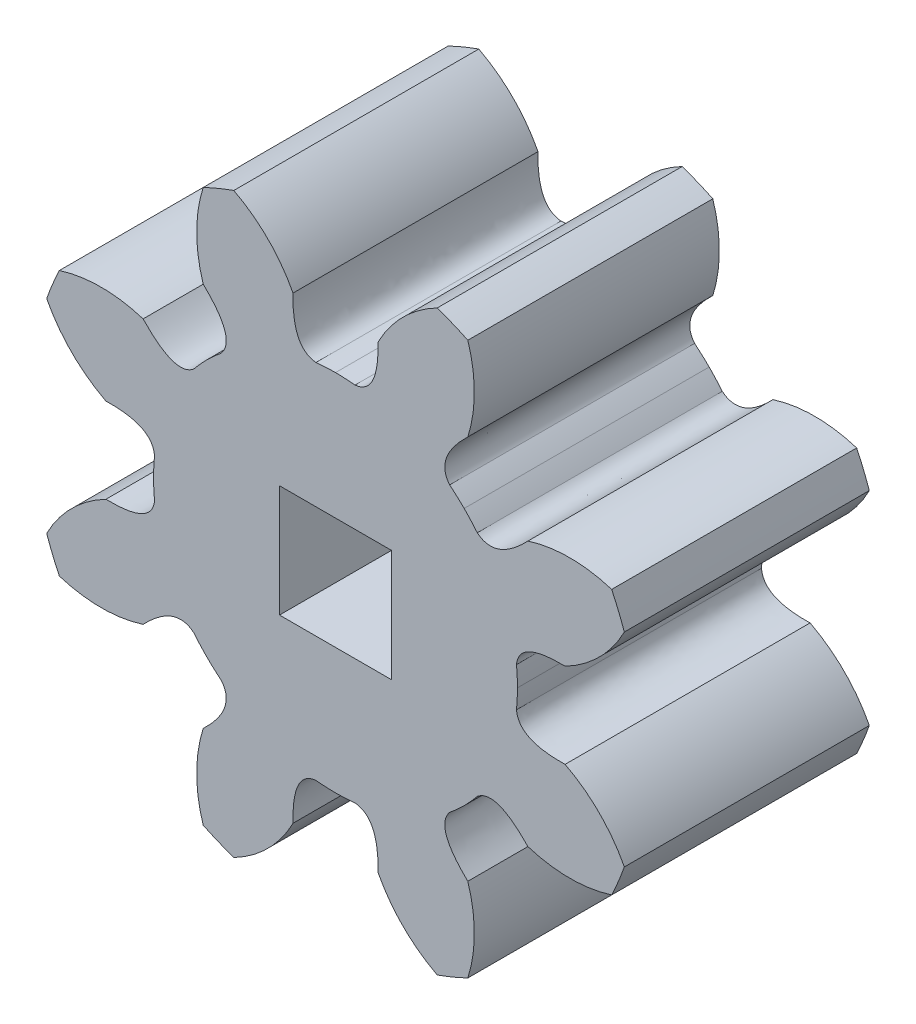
ISO-10303-21;
HEADER;
FILE_DESCRIPTION(('STEP AP214'),'2;1');
FILE_NAME('part.step','',(''),(''),'','','');
FILE_SCHEMA(('AUTOMOTIVE_DESIGN { 1 0 10303 214 1 1 1 1 }'));
ENDSEC;
DATA;
#1=APPLICATION_CONTEXT('core data for automotive mechanical design processes');
#2=APPLICATION_PROTOCOL_DEFINITION('international standard','automotive_design',2000,#1);
#3=PRODUCT_CONTEXT('',#1,'mechanical');
#4=PRODUCT('Part','Part','',(#3));
#5=PRODUCT_RELATED_PRODUCT_CATEGORY('part','',(#4));
#6=PRODUCT_DEFINITION_FORMATION('','',#4);
#7=PRODUCT_DEFINITION_CONTEXT('part definition',#1,'design');
#8=PRODUCT_DEFINITION('design','',#6,#7);
#9=PRODUCT_DEFINITION_SHAPE('','',#8);
#10=(LENGTH_UNIT() NAMED_UNIT(*) SI_UNIT(.MILLI.,.METRE.));
#11=(NAMED_UNIT(*) PLANE_ANGLE_UNIT() SI_UNIT($,.RADIAN.));
#12=(NAMED_UNIT(*) SI_UNIT($,.STERADIAN.) SOLID_ANGLE_UNIT());
#13=UNCERTAINTY_MEASURE_WITH_UNIT(LENGTH_MEASURE(1.E-05),#10,'distance_accuracy_value','');
#14=(GEOMETRIC_REPRESENTATION_CONTEXT(3) GLOBAL_UNCERTAINTY_ASSIGNED_CONTEXT((#13)) GLOBAL_UNIT_ASSIGNED_CONTEXT((#10,
#11,#12)) REPRESENTATION_CONTEXT('',''));
#15=CARTESIAN_POINT('',(0.,0.,0.));
#16=DIRECTION('',(0.,0.,1.));
#17=DIRECTION('',(1.,0.,0.));
#18=AXIS2_PLACEMENT_3D('',#15,#16,#17);
#19=CARTESIAN_POINT('',(7.,0.,7.));
#20=DIRECTION('',(0.,0.,-1.));
#21=DIRECTION('',(-1.,0.,0.));
#22=AXIS2_PLACEMENT_3D('',#19,#20,#21);
#23=CYLINDRICAL_SURFACE('',#22,8.7499185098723);
#24=DIRECTION('',(0.,0.,-1.));
#25=VECTOR('',#24,1.);
#26=CARTESIAN_POINT('',(-0.891023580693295,3.78058471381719,3.5));
#27=LINE('',#26,#25);
#28=CARTESIAN_POINT('',(-0.891023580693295,3.78058471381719,0.));
#29=VERTEX_POINT('',#28);
#30=CARTESIAN_POINT('',(-0.891023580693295,3.78058471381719,7.));
#31=VERTEX_POINT('',#30);
#32=EDGE_CURVE('E850',#29,#31,#27,.F.);
#33=ORIENTED_EDGE('',*,*,#32,.F.);
#34=CARTESIAN_POINT('',(7.,0.,0.));
#35=DIRECTION('',(0.,0.,1.));
#36=DIRECTION('',(1.,0.,0.));
#37=AXIS2_PLACEMENT_3D('',#34,#35,#36);
#38=CIRCLE('',#37,8.7499185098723);
#39=CARTESIAN_POINT('',(-1.25307337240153,2.9065191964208,0.));
#40=VERTEX_POINT('',#39);
#41=EDGE_CURVE('E908',#29,#40,#38,.T.);
#42=ORIENTED_EDGE('',*,*,#41,.T.);
#43=DIRECTION('',(0.,0.,-1.));
#44=VECTOR('',#43,1.);
#45=CARTESIAN_POINT('',(-1.25307337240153,2.9065191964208,3.5));
#46=LINE('',#45,#44);
#47=CARTESIAN_POINT('',(-1.25307337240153,2.9065191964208,7.));
#48=VERTEX_POINT('',#47);
#49=EDGE_CURVE('E1039',#48,#40,#46,.T.);
#50=ORIENTED_EDGE('',*,*,#49,.F.);
#51=CARTESIAN_POINT('',(7.,0.,7.));
#52=DIRECTION('',(0.,0.,1.));
#53=DIRECTION('',(1.,0.,0.));
#54=AXIS2_PLACEMENT_3D('',#51,#52,#53);
#55=CIRCLE('',#54,8.7499185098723);
#56=EDGE_CURVE('E902',#31,#48,#55,.T.);
#57=ORIENTED_EDGE('',*,*,#56,.F.);
#58=EDGE_LOOP('',(#33,#42,#50,#57));
#59=FACE_BOUND('',#58,.T.);
#60=ADVANCED_FACE('F45',(#59),#23,.T.);
#61=DIRECTION('',(0.,0.,-1.));
#62=VECTOR('',#61,1.);
#63=CARTESIAN_POINT('',(3.21941528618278,7.89102358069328,3.5));
#64=LINE('',#63,#62);
#65=CARTESIAN_POINT('',(3.21941528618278,7.89102358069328,7.));
#66=VERTEX_POINT('',#65);
#67=CARTESIAN_POINT('',(3.21941528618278,7.89102358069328,0.));
#68=VERTEX_POINT('',#67);
#69=EDGE_CURVE('E1041',#66,#68,#64,.T.);
#70=ORIENTED_EDGE('',*,*,#69,.F.);
#71=CARTESIAN_POINT('',(4.09348080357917,8.25307337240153,7.));
#72=VERTEX_POINT('',#71);
#73=EDGE_CURVE('E897',#72,#66,#55,.T.);
#74=ORIENTED_EDGE('',*,*,#73,.F.);
#75=DIRECTION('',(0.,0.,-1.));
#76=VECTOR('',#75,1.);
#77=CARTESIAN_POINT('',(4.09348080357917,8.25307337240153,3.5));
#78=LINE('',#77,#76);
#79=CARTESIAN_POINT('',(4.09348080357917,8.25307337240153,0.));
#80=VERTEX_POINT('',#79);
#81=EDGE_CURVE('E893',#80,#72,#78,.F.);
#82=ORIENTED_EDGE('',*,*,#81,.F.);
#83=EDGE_CURVE('E904',#80,#68,#38,.T.);
#84=ORIENTED_EDGE('',*,*,#83,.T.);
#85=EDGE_LOOP('',(#70,#74,#82,#84));
#86=FACE_BOUND('',#85,.T.);
#87=ADVANCED_FACE('F1078',(#86),#23,.T.);
#88=DIRECTION('',(0.,0.,-1.));
#89=VECTOR('',#88,1.);
#90=CARTESIAN_POINT('',(14.8910235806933,-3.78058471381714,3.5));
#91=LINE('',#90,#89);
#92=CARTESIAN_POINT('',(14.8910235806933,-3.78058471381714,0.));
#93=VERTEX_POINT('',#92);
#94=CARTESIAN_POINT('',(14.8910235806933,-3.78058471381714,7.));
#95=VERTEX_POINT('',#94);
#96=EDGE_CURVE('E1042',#93,#95,#91,.F.);
#97=ORIENTED_EDGE('',*,*,#96,.F.);
#98=CARTESIAN_POINT('',(15.2530733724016,-2.90651919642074,0.));
#99=VERTEX_POINT('',#98);
#100=EDGE_CURVE('E962',#93,#99,#38,.T.);
#101=ORIENTED_EDGE('',*,*,#100,.T.);
#102=DIRECTION('',(0.,0.,-1.));
#103=VECTOR('',#102,1.);
#104=CARTESIAN_POINT('',(15.2530733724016,-2.90651919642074,3.5));
#105=LINE('',#104,#103);
#106=CARTESIAN_POINT('',(15.2530733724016,-2.90651919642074,7.));
#107=VERTEX_POINT('',#106);
#108=EDGE_CURVE('E1097',#107,#99,#105,.T.);
#109=ORIENTED_EDGE('',*,*,#108,.F.);
#110=EDGE_CURVE('E1006',#95,#107,#55,.T.);
#111=ORIENTED_EDGE('',*,*,#110,.F.);
#112=EDGE_LOOP('',(#97,#101,#109,#111));
#113=FACE_BOUND('',#112,.T.);
#114=ADVANCED_FACE('F1082',(#113),#23,.T.);
#115=DIRECTION('',(0.,0.,-1.));
#116=VECTOR('',#115,1.);
#117=CARTESIAN_POINT('',(3.21941528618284,-7.89102358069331,3.5));
#118=LINE('',#117,#116);
#119=CARTESIAN_POINT('',(3.21941528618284,-7.89102358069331,0.));
#120=VERTEX_POINT('',#119);
#121=CARTESIAN_POINT('',(3.21941528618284,-7.89102358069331,7.));
#122=VERTEX_POINT('',#121);
#123=EDGE_CURVE('E943',#120,#122,#118,.F.);
#124=ORIENTED_EDGE('',*,*,#123,.F.);
#125=CARTESIAN_POINT('',(4.09348080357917,-8.25307337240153,0.));
#126=VERTEX_POINT('',#125);
#127=EDGE_CURVE('E950',#120,#126,#38,.T.);
#128=ORIENTED_EDGE('',*,*,#127,.T.);
#129=DIRECTION('',(0.,0.,-1.));
#130=VECTOR('',#129,1.);
#131=CARTESIAN_POINT('',(4.09348080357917,-8.25307337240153,3.5));
#132=LINE('',#131,#130);
#133=CARTESIAN_POINT('',(4.09348080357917,-8.25307337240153,7.));
#134=VERTEX_POINT('',#133);
#135=EDGE_CURVE('E1391',#134,#126,#132,.T.);
#136=ORIENTED_EDGE('',*,*,#135,.F.);
#137=EDGE_CURVE('E1018',#122,#134,#55,.T.);
#138=ORIENTED_EDGE('',*,*,#137,.F.);
#139=EDGE_LOOP('',(#124,#128,#136,#138));
#140=FACE_BOUND('',#139,.T.);
#141=ADVANCED_FACE('F1400',(#140),#23,.T.);
#142=DIRECTION('',(0.,0.,-1.));
#143=VECTOR('',#142,1.);
#144=CARTESIAN_POINT('',(-1.25307337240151,-2.90651919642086,3.5));
#145=LINE('',#144,#143);
#146=CARTESIAN_POINT('',(-1.25307337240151,-2.90651919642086,0.));
#147=VERTEX_POINT('',#146);
#148=CARTESIAN_POINT('',(-1.25307337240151,-2.90651919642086,7.));
#149=VERTEX_POINT('',#148);
#150=EDGE_CURVE('E929',#147,#149,#145,.F.);
#151=ORIENTED_EDGE('',*,*,#150,.F.);
#152=CARTESIAN_POINT('',(-0.891023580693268,-3.78058471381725,0.));
#153=VERTEX_POINT('',#152);
#154=EDGE_CURVE('E939',#147,#153,#38,.T.);
#155=ORIENTED_EDGE('',*,*,#154,.T.);
#156=DIRECTION('',(0.,0.,-1.));
#157=VECTOR('',#156,1.);
#158=CARTESIAN_POINT('',(-0.891023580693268,-3.78058471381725,3.5));
#159=LINE('',#158,#157);
#160=CARTESIAN_POINT('',(-0.891023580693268,-3.78058471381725,7.));
#161=VERTEX_POINT('',#160);
#162=EDGE_CURVE('E944',#161,#153,#159,.T.);
#163=ORIENTED_EDGE('',*,*,#162,.F.);
#164=EDGE_CURVE('E941',#149,#161,#55,.T.);
#165=ORIENTED_EDGE('',*,*,#164,.F.);
#166=EDGE_LOOP('',(#151,#155,#163,#165));
#167=FACE_BOUND('',#166,.T.);
#168=ADVANCED_FACE('F937',(#167),#23,.T.);
#169=DIRECTION('',(0.,0.,-1.));
#170=VECTOR('',#169,1.);
#171=CARTESIAN_POINT('',(9.90651919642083,-8.25307337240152,3.5));
#172=LINE('',#171,#170);
#173=CARTESIAN_POINT('',(9.90651919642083,-8.25307337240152,0.));
#174=VERTEX_POINT('',#173);
#175=CARTESIAN_POINT('',(9.90651919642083,-8.25307337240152,7.));
#176=VERTEX_POINT('',#175);
#177=EDGE_CURVE('E1388',#174,#176,#172,.F.);
#178=ORIENTED_EDGE('',*,*,#177,.F.);
#179=CARTESIAN_POINT('',(10.7805847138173,-7.89102358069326,0.));
#180=VERTEX_POINT('',#179);
#181=EDGE_CURVE('E955',#174,#180,#38,.T.);
#182=ORIENTED_EDGE('',*,*,#181,.T.);
#183=DIRECTION('',(0.,0.,-1.));
#184=VECTOR('',#183,1.);
#185=CARTESIAN_POINT('',(10.7805847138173,-7.89102358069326,3.5));
#186=LINE('',#185,#184);
#187=CARTESIAN_POINT('',(10.7805847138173,-7.89102358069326,7.));
#188=VERTEX_POINT('',#187);
#189=EDGE_CURVE('E1385',#188,#180,#186,.T.);
#190=ORIENTED_EDGE('',*,*,#189,.F.);
#191=EDGE_CURVE('E1012',#176,#188,#55,.T.);
#192=ORIENTED_EDGE('',*,*,#191,.F.);
#193=EDGE_LOOP('',(#178,#182,#190,#192));
#194=FACE_BOUND('',#193,.T.);
#195=ADVANCED_FACE('F1090',(#194),#23,.T.);
#196=DIRECTION('',(0.,0.,-1.));
#197=VECTOR('',#196,1.);
#198=CARTESIAN_POINT('',(15.2530733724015,2.90651919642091,3.5));
#199=LINE('',#198,#197);
#200=CARTESIAN_POINT('',(15.2530733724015,2.90651919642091,0.));
#201=VERTEX_POINT('',#200);
#202=CARTESIAN_POINT('',(15.2530733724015,2.90651919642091,7.));
#203=VERTEX_POINT('',#202);
#204=EDGE_CURVE('E1094',#201,#203,#199,.F.);
#205=ORIENTED_EDGE('',*,*,#204,.F.);
#206=CARTESIAN_POINT('',(14.8910235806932,3.7805847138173,0.));
#207=VERTEX_POINT('',#206);
#208=EDGE_CURVE('E969',#201,#207,#38,.T.);
#209=ORIENTED_EDGE('',*,*,#208,.T.);
#210=DIRECTION('',(0.,0.,-1.));
#211=VECTOR('',#210,1.);
#212=CARTESIAN_POINT('',(14.8910235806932,3.7805847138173,3.5));
#213=LINE('',#212,#211);
#214=CARTESIAN_POINT('',(14.8910235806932,3.7805847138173,7.));
#215=VERTEX_POINT('',#214);
#216=EDGE_CURVE('E1098',#215,#207,#213,.T.);
#217=ORIENTED_EDGE('',*,*,#216,.F.);
#218=EDGE_CURVE('E1003',#203,#215,#55,.T.);
#219=ORIENTED_EDGE('',*,*,#218,.F.);
#220=EDGE_LOOP('',(#205,#209,#217,#219));
#221=FACE_BOUND('',#220,.T.);
#222=ADVANCED_FACE('F1085',(#221),#23,.T.);
#223=DIRECTION('',(0.,0.,-1.));
#224=VECTOR('',#223,1.);
#225=CARTESIAN_POINT('',(10.7805847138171,7.89102358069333,3.5));
#226=LINE('',#225,#224);
#227=CARTESIAN_POINT('',(10.7805847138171,7.89102358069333,0.));
#228=VERTEX_POINT('',#227);
#229=CARTESIAN_POINT('',(10.7805847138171,7.89102358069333,7.));
#230=VERTEX_POINT('',#229);
#231=EDGE_CURVE('E987',#228,#230,#226,.F.);
#232=ORIENTED_EDGE('',*,*,#231,.F.);
#233=CARTESIAN_POINT('',(9.90651919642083,8.25307337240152,0.));
#234=VERTEX_POINT('',#233);
#235=EDGE_CURVE('E896',#228,#234,#38,.T.);
#236=ORIENTED_EDGE('',*,*,#235,.T.);
#237=DIRECTION('',(0.,0.,-1.));
#238=VECTOR('',#237,1.);
#239=CARTESIAN_POINT('',(9.90651919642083,8.25307337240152,3.5));
#240=LINE('',#239,#238);
#241=CARTESIAN_POINT('',(9.90651919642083,8.25307337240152,7.));
#242=VERTEX_POINT('',#241);
#243=EDGE_CURVE('E889',#242,#234,#240,.T.);
#244=ORIENTED_EDGE('',*,*,#243,.F.);
#245=EDGE_CURVE('E903',#230,#242,#55,.T.);
#246=ORIENTED_EDGE('',*,*,#245,.F.);
#247=EDGE_LOOP('',(#232,#236,#244,#246));
#248=FACE_BOUND('',#247,.T.);
#249=ADVANCED_FACE('F985',(#248),#23,.T.);
#250=CARTESIAN_POINT('',(7.,0.,7.));
#251=DIRECTION('',(0.,0.,1.));
#252=DIRECTION('',(1.,0.,0.));
#253=AXIS2_PLACEMENT_3D('',#250,#251,#252);
#254=PLANE('',#253);
#255=DIRECTION('',(0.,-1.,0.));
#256=VECTOR('',#255,1.);
#257=CARTESIAN_POINT('',(5.4,1.6,7.));
#258=LINE('',#257,#256);
#259=CARTESIAN_POINT('',(5.4,1.6,7.));
#260=VERTEX_POINT('',#259);
#261=CARTESIAN_POINT('',(5.4,-1.6,7.));
#262=VERTEX_POINT('',#261);
#263=EDGE_CURVE('E60',#260,#262,#258,.T.);
#264=ORIENTED_EDGE('',*,*,#263,.F.);
#265=DIRECTION('',(-1.,0.,0.));
#266=VECTOR('',#265,1.);
#267=CARTESIAN_POINT('',(5.4,1.6,7.));
#268=LINE('',#267,#266);
#269=CARTESIAN_POINT('',(8.6,1.6,7.));
#270=VERTEX_POINT('',#269);
#271=EDGE_CURVE('E442',#270,#260,#268,.T.);
#272=ORIENTED_EDGE('',*,*,#271,.F.);
#273=DIRECTION('',(0.,1.,0.));
#274=VECTOR('',#273,1.);
#275=CARTESIAN_POINT('',(8.6,1.6,7.));
#276=LINE('',#275,#274);
#277=CARTESIAN_POINT('',(8.6,-1.6,7.));
#278=VERTEX_POINT('',#277);
#279=EDGE_CURVE('E446',#278,#270,#276,.T.);
#280=ORIENTED_EDGE('',*,*,#279,.F.);
#281=DIRECTION('',(1.,0.,0.));
#282=VECTOR('',#281,1.);
#283=CARTESIAN_POINT('',(5.4,-1.6,7.));
#284=LINE('',#283,#282);
#285=EDGE_CURVE('E455',#262,#278,#284,.T.);
#286=ORIENTED_EDGE('',*,*,#285,.F.);
#287=EDGE_LOOP('',(#264,#272,#280,#286));
#288=FACE_BOUND('',#287,.T.);
#289=CARTESIAN_POINT('',(1.50244276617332,3.78012214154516,7.));
#290=CARTESIAN_POINT('',(2.41472815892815,2.82040335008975,7.));
#291=CARTESIAN_POINT('',(2.94902060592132,3.26172094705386,7.));
#292=B_SPLINE_CURVE_WITH_KNOTS('',2,(#289,#290,#291),.UNSPECIFIED.,.F.,.F.,(3,3),(0.,1.),.UNSPECIFIED.);
#293=CARTESIAN_POINT('',(1.50244276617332,3.78012214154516,7.));
#294=VERTEX_POINT('',#293);
#295=CARTESIAN_POINT('',(2.94902060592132,3.26172094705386,7.));
#296=VERTEX_POINT('',#295);
#297=EDGE_CURVE('E788',#294,#296,#292,.T.);
#298=ORIENTED_EDGE('',*,*,#297,.F.);
#299=CARTESIAN_POINT('',(0.304983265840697,0.0221536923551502,7.));
#300=DIRECTION('',(0.,0.,-1.));
#301=DIRECTION('',(-0.707106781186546,-0.707106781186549,0.));
#302=AXIS2_PLACEMENT_3D('',#299,#300,#301);
#303=CIRCLE('',#302,3.94413946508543);
#304=EDGE_CURVE('E785',#31,#294,#303,.T.);
#305=ORIENTED_EDGE('',*,*,#304,.F.);
#306=ORIENTED_EDGE('',*,*,#56,.T.);
#307=CARTESIAN_POINT('',(2.25024324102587,4.71842670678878,7.));
#308=DIRECTION('',(0.,0.,-1.));
#309=DIRECTION('',(0.,1.,0.));
#310=AXIS2_PLACEMENT_3D('',#307,#308,#309);
#311=CIRCLE('',#310,3.94413946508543);
#312=CARTESIAN_POINT('',(0.439689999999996,1.21440999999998,7.));
#313=VERTEX_POINT('',#312);
#314=EDGE_CURVE('E728',#313,#48,#311,.T.);
#315=ORIENTED_EDGE('',*,*,#314,.F.);
#316=CARTESIAN_POINT('',(1.82914,0.558089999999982,7.));
#317=CARTESIAN_POINT('',(1.76339685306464,1.24795047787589,7.));
#318=CARTESIAN_POINT('',(0.439689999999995,1.21440999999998,7.));
#319=B_SPLINE_CURVE_WITH_KNOTS('',2,(#316,#317,#318),.UNSPECIFIED.,.F.,.F.,(3,3),(0.,1.),.UNSPECIFIED.);
#320=CARTESIAN_POINT('',(1.82914,0.558089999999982,7.));
#321=VERTEX_POINT('',#320);
#322=EDGE_CURVE('E721',#321,#313,#319,.T.);
#323=ORIENTED_EDGE('',*,*,#322,.F.);
#324=CARTESIAN_POINT('',(8.35596585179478,-0.0625061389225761,7.));
#325=DIRECTION('',(0.,0.,-1.));
#326=DIRECTION('',(0.,1.,0.));
#327=AXIS2_PLACEMENT_3D('',#324,#325,#326);
#328=CIRCLE('',#327,6.55626381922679);
#329=CARTESIAN_POINT('',(1.8,0.,7.));
#330=VERTEX_POINT('',#329);
#331=EDGE_CURVE('E729',#330,#321,#328,.T.);
#332=ORIENTED_EDGE('',*,*,#331,.F.);
#333=CARTESIAN_POINT('',(8.35596585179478,0.0625061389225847,7.));
#334=DIRECTION('',(0.,0.,-1.));
#335=DIRECTION('',(0.,-1.,0.));
#336=AXIS2_PLACEMENT_3D('',#333,#334,#335);
#337=CIRCLE('',#336,6.55626381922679);
#338=CARTESIAN_POINT('',(1.82914,-0.558090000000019,7.));
#339=VERTEX_POINT('',#338);
#340=EDGE_CURVE('E1303',#339,#330,#337,.T.);
#341=ORIENTED_EDGE('',*,*,#340,.F.);
#342=CARTESIAN_POINT('',(0.439690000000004,-1.21441000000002,7.));
#343=CARTESIAN_POINT('',(1.76339685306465,-1.24795047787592,7.));
#344=CARTESIAN_POINT('',(1.82914,-0.558090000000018,7.));
#345=B_SPLINE_CURVE_WITH_KNOTS('',2,(#342,#343,#344),.UNSPECIFIED.,.F.,.F.,(3,3),(0.,1.),.UNSPECIFIED.);
#346=CARTESIAN_POINT('',(0.439690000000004,-1.21441000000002,7.));
#347=VERTEX_POINT('',#346);
#348=EDGE_CURVE('E1298',#347,#339,#345,.T.);
#349=ORIENTED_EDGE('',*,*,#348,.F.);
#350=CARTESIAN_POINT('',(2.2502432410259,-4.71842670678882,7.));
#351=DIRECTION('',(0.,0.,-1.));
#352=DIRECTION('',(0.,-1.,0.));
#353=AXIS2_PLACEMENT_3D('',#350,#351,#352);
#354=CIRCLE('',#353,3.94413946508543);
#355=EDGE_CURVE('E768',#149,#347,#354,.T.);
#356=ORIENTED_EDGE('',*,*,#355,.F.);
#357=ORIENTED_EDGE('',*,*,#164,.T.);
#358=CARTESIAN_POINT('',(0.304983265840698,-0.0221536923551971,7.));
#359=DIRECTION('',(0.,0.,-1.));
#360=DIRECTION('',(-0.707106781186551,0.707106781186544,0.));
#361=AXIS2_PLACEMENT_3D('',#358,#359,#360);
#362=CIRCLE('',#361,3.94413946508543);
#363=CARTESIAN_POINT('',(1.50244276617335,-3.78012214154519,7.));
#364=VERTEX_POINT('',#363);
#365=EDGE_CURVE('E1248',#364,#161,#362,.T.);
#366=ORIENTED_EDGE('',*,*,#365,.F.);
#367=CARTESIAN_POINT('',(2.94902060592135,-3.26172094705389,7.));
#368=CARTESIAN_POINT('',(2.41472815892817,-2.82040335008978,7.));
#369=CARTESIAN_POINT('',(1.50244276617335,-3.78012214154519,7.));
#370=B_SPLINE_CURVE_WITH_KNOTS('',2,(#367,#368,#369),.UNSPECIFIED.,.F.,.F.,(3,3),(0.,1.),.UNSPECIFIED.);
#371=CARTESIAN_POINT('',(2.94902060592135,-3.26172094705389,7.));
#372=VERTEX_POINT('',#371);
#373=EDGE_CURVE('E1242',#372,#364,#370,.T.);
#374=ORIENTED_EDGE('',*,*,#373,.F.);
#375=CARTESIAN_POINT('',(8.00301116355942,0.914614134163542,7.));
#376=DIRECTION('',(0.,0.,-1.));
#377=DIRECTION('',(-0.707106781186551,0.707106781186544,0.));
#378=AXIS2_PLACEMENT_3D('',#375,#376,#377);
#379=CIRCLE('',#378,6.55626381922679);
#380=CARTESIAN_POINT('',(3.32304473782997,-3.67695526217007,7.));
#381=VERTEX_POINT('',#380);
#382=EDGE_CURVE('E1249',#381,#372,#379,.T.);
#383=ORIENTED_EDGE('',*,*,#382,.F.);
#384=CARTESIAN_POINT('',(7.91461413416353,1.00301116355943,7.));
#385=DIRECTION('',(0.,0.,-1.));
#386=DIRECTION('',(0.707106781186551,-0.707106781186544,0.));
#387=AXIS2_PLACEMENT_3D('',#384,#385,#386);
#388=CIRCLE('',#387,6.55626381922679);
#389=CARTESIAN_POINT('',(3.73827905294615,-4.05097939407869,7.));
#390=VERTEX_POINT('',#389);
#391=EDGE_CURVE('E690',#390,#381,#388,.T.);
#392=ORIENTED_EDGE('',*,*,#391,.F.);
#393=CARTESIAN_POINT('',(3.21987785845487,-5.49755723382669,7.));
#394=CARTESIAN_POINT('',(4.17959664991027,-4.58527184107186,7.));
#395=CARTESIAN_POINT('',(3.73827905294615,-4.05097939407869,7.));
#396=B_SPLINE_CURVE_WITH_KNOTS('',2,(#393,#394,#395),.UNSPECIFIED.,.F.,.F.,(3,3),(0.,1.),.UNSPECIFIED.);
#397=CARTESIAN_POINT('',(3.21987785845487,-5.49755723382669,7.));
#398=VERTEX_POINT('',#397);
#399=EDGE_CURVE('E683',#398,#390,#396,.T.);
#400=ORIENTED_EDGE('',*,*,#399,.F.);
#401=CARTESIAN_POINT('',(6.97784630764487,-6.6950167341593,7.));
#402=DIRECTION('',(0.,0.,-1.));
#403=DIRECTION('',(0.707106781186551,-0.707106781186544,0.));
#404=AXIS2_PLACEMENT_3D('',#401,#402,#403);
#405=CIRCLE('',#404,3.94413946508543);
#406=EDGE_CURVE('E680',#122,#398,#405,.T.);
#407=ORIENTED_EDGE('',*,*,#406,.F.);
#408=ORIENTED_EDGE('',*,*,#137,.T.);
#409=CARTESIAN_POINT('',(2.2815732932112,-4.74975675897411,7.));
#410=DIRECTION('',(0.,0.,-1.));
#411=DIRECTION('',(-1.,0.,0.));
#412=AXIS2_PLACEMENT_3D('',#409,#410,#411);
#413=CIRCLE('',#412,3.94413946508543);
#414=CARTESIAN_POINT('',(5.78559,-6.56031,7.));
#415=VERTEX_POINT('',#414);
#416=EDGE_CURVE('E623',#415,#134,#413,.T.);
#417=ORIENTED_EDGE('',*,*,#416,.F.);
#418=CARTESIAN_POINT('',(6.44191,-5.17086,7.));
#419=CARTESIAN_POINT('',(5.75204952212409,-5.23660314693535,7.));
#420=CARTESIAN_POINT('',(5.78559,-6.56031,7.));
#421=B_SPLINE_CURVE_WITH_KNOTS('',2,(#418,#419,#420),.UNSPECIFIED.,.F.,.F.,(3,3),(0.,1.),.UNSPECIFIED.);
#422=CARTESIAN_POINT('',(6.44191,-5.17086,7.));
#423=VERTEX_POINT('',#422);
#424=EDGE_CURVE('E616',#423,#415,#421,.T.);
#425=ORIENTED_EDGE('',*,*,#424,.F.);
#426=CARTESIAN_POINT('',(7.06250613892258,1.35596585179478,7.));
#427=DIRECTION('',(0.,0.,-1.));
#428=DIRECTION('',(-1.,0.,0.));
#429=AXIS2_PLACEMENT_3D('',#426,#427,#428);
#430=CIRCLE('',#429,6.55626381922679);
#431=CARTESIAN_POINT('',(7.,-5.2,7.));
#432=VERTEX_POINT('',#431);
#433=EDGE_CURVE('E624',#432,#423,#430,.T.);
#434=ORIENTED_EDGE('',*,*,#433,.F.);
#435=CARTESIAN_POINT('',(6.93749386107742,1.35596585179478,7.));
#436=DIRECTION('',(0.,0.,-1.));
#437=DIRECTION('',(1.,0.,0.));
#438=AXIS2_PLACEMENT_3D('',#435,#436,#437);
#439=CIRCLE('',#438,6.55626381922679);
#440=CARTESIAN_POINT('',(7.55809,-5.17086,7.));
#441=VERTEX_POINT('',#440);
#442=EDGE_CURVE('E1222',#441,#432,#439,.T.);
#443=ORIENTED_EDGE('',*,*,#442,.F.);
#444=CARTESIAN_POINT('',(8.21441,-6.56031,7.));
#445=CARTESIAN_POINT('',(8.24795047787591,-5.23660314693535,7.));
#446=CARTESIAN_POINT('',(7.55809,-5.17086,7.));
#447=B_SPLINE_CURVE_WITH_KNOTS('',2,(#444,#445,#446),.UNSPECIFIED.,.F.,.F.,(3,3),(0.,1.),.UNSPECIFIED.);
#448=CARTESIAN_POINT('',(8.21441,-6.56031,7.));
#449=VERTEX_POINT('',#448);
#450=EDGE_CURVE('E1217',#449,#441,#447,.T.);
#451=ORIENTED_EDGE('',*,*,#450,.F.);
#452=CARTESIAN_POINT('',(11.7184267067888,-4.74975675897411,7.));
#453=DIRECTION('',(0.,0.,-1.));
#454=DIRECTION('',(1.,0.,0.));
#455=AXIS2_PLACEMENT_3D('',#452,#453,#454);
#456=CIRCLE('',#455,3.94413946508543);
#457=EDGE_CURVE('E663',#176,#449,#456,.T.);
#458=ORIENTED_EDGE('',*,*,#457,.F.);
#459=ORIENTED_EDGE('',*,*,#191,.T.);
#460=CARTESIAN_POINT('',(7.02215369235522,-6.6950167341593,7.));
#461=DIRECTION('',(0.,0.,-1.));
#462=DIRECTION('',(-0.707106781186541,-0.707106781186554,0.));
#463=AXIS2_PLACEMENT_3D('',#460,#461,#462);
#464=CIRCLE('',#463,3.94413946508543);
#465=CARTESIAN_POINT('',(10.7801221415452,-5.49755723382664,7.));
#466=VERTEX_POINT('',#465);
#467=EDGE_CURVE('E1165',#466,#188,#464,.T.);
#468=ORIENTED_EDGE('',*,*,#467,.F.);
#469=CARTESIAN_POINT('',(10.2617209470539,-4.05097939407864,7.));
#470=CARTESIAN_POINT('',(9.8204033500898,-4.58527184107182,7.));
#471=CARTESIAN_POINT('',(10.7801221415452,-5.49755723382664,7.));
#472=B_SPLINE_CURVE_WITH_KNOTS('',2,(#469,#470,#471),.UNSPECIFIED.,.F.,.F.,(3,3),(0.,1.),.UNSPECIFIED.);
#473=CARTESIAN_POINT('',(10.2617209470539,-4.05097939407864,7.));
#474=VERTEX_POINT('',#473);
#475=EDGE_CURVE('E1159',#474,#466,#472,.T.);
#476=ORIENTED_EDGE('',*,*,#475,.F.);
#477=CARTESIAN_POINT('',(6.08538586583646,1.00301116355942,7.));
#478=DIRECTION('',(0.,0.,-1.));
#479=DIRECTION('',(-0.707106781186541,-0.707106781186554,0.));
#480=AXIS2_PLACEMENT_3D('',#477,#478,#479);
#481=CIRCLE('',#480,6.55626381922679);
#482=CARTESIAN_POINT('',(10.6769552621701,-3.67695526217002,7.));
#483=VERTEX_POINT('',#482);
#484=EDGE_CURVE('E1166',#483,#474,#481,.T.);
#485=ORIENTED_EDGE('',*,*,#484,.F.);
#486=CARTESIAN_POINT('',(5.99698883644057,0.914614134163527,7.));
#487=DIRECTION('',(0.,0.,-1.));
#488=DIRECTION('',(0.707106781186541,0.707106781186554,0.));
#489=AXIS2_PLACEMENT_3D('',#486,#487,#488);
#490=CIRCLE('',#489,6.55626381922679);
#491=CARTESIAN_POINT('',(11.0509793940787,-3.26172094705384,7.));
#492=VERTEX_POINT('',#491);
#493=EDGE_CURVE('E585',#492,#483,#490,.T.);
#494=ORIENTED_EDGE('',*,*,#493,.F.);
#495=CARTESIAN_POINT('',(12.4975572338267,-3.78012214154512,7.));
#496=CARTESIAN_POINT('',(11.5852718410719,-2.82040335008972,7.));
#497=CARTESIAN_POINT('',(11.0509793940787,-3.26172094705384,7.));
#498=B_SPLINE_CURVE_WITH_KNOTS('',2,(#495,#496,#497),.UNSPECIFIED.,.F.,.F.,(3,3),(0.,1.),.UNSPECIFIED.);
#499=CARTESIAN_POINT('',(12.4975572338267,-3.78012214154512,7.));
#500=VERTEX_POINT('',#499);
#501=EDGE_CURVE('E578',#500,#492,#498,.T.);
#502=ORIENTED_EDGE('',*,*,#501,.F.);
#503=CARTESIAN_POINT('',(13.6950167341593,-0.0221536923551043,7.));
#504=DIRECTION('',(0.,0.,-1.));
#505=DIRECTION('',(0.707106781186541,0.707106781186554,0.));
#506=AXIS2_PLACEMENT_3D('',#503,#504,#505);
#507=CIRCLE('',#506,3.94413946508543);
#508=EDGE_CURVE('E575',#95,#500,#507,.T.);
#509=ORIENTED_EDGE('',*,*,#508,.F.);
#510=ORIENTED_EDGE('',*,*,#110,.T.);
#511=CARTESIAN_POINT('',(11.7497567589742,-4.71842670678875,7.));
#512=DIRECTION('',(0.,0.,-1.));
#513=DIRECTION('',(0.,-1.,0.));
#514=AXIS2_PLACEMENT_3D('',#511,#512,#513);
#515=CIRCLE('',#514,3.94413946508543);
#516=CARTESIAN_POINT('',(13.56031,-1.21440999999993,7.));
#517=VERTEX_POINT('',#516);
#518=EDGE_CURVE('E518',#517,#107,#515,.T.);
#519=ORIENTED_EDGE('',*,*,#518,.F.);
#520=CARTESIAN_POINT('',(12.17086,-0.558089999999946,7.));
#521=CARTESIAN_POINT('',(12.2366031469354,-1.24795047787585,7.));
#522=CARTESIAN_POINT('',(13.56031,-1.21440999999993,7.));
#523=B_SPLINE_CURVE_WITH_KNOTS('',2,(#520,#521,#522),.UNSPECIFIED.,.F.,.F.,(3,3),(0.,1.),.UNSPECIFIED.);
#524=CARTESIAN_POINT('',(12.17086,-0.558089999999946,7.));
#525=VERTEX_POINT('',#524);
#526=EDGE_CURVE('E511',#525,#517,#523,.T.);
#527=ORIENTED_EDGE('',*,*,#526,.F.);
#528=CARTESIAN_POINT('',(5.64403414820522,0.0625061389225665,7.));
#529=DIRECTION('',(0.,0.,-1.));
#530=DIRECTION('',(0.,-1.,0.));
#531=AXIS2_PLACEMENT_3D('',#528,#529,#530);
#532=CIRCLE('',#531,6.55626381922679);
#533=CARTESIAN_POINT('',(12.2,0.,7.));
#534=VERTEX_POINT('',#533);
#535=EDGE_CURVE('E519',#534,#525,#532,.T.);
#536=ORIENTED_EDGE('',*,*,#535,.F.);
#537=CARTESIAN_POINT('',(5.64403414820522,-0.0625061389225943,7.));
#538=DIRECTION('',(0.,0.,-1.));
#539=DIRECTION('',(0.,1.,0.));
#540=AXIS2_PLACEMENT_3D('',#537,#538,#539);
#541=CIRCLE('',#540,6.55626381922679);
#542=CARTESIAN_POINT('',(12.17086,0.558090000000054,7.));
#543=VERTEX_POINT('',#542);
#544=EDGE_CURVE('E1140',#543,#534,#541,.T.);
#545=ORIENTED_EDGE('',*,*,#544,.F.);
#546=CARTESIAN_POINT('',(13.56031,1.21441000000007,7.));
#547=CARTESIAN_POINT('',(12.2366031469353,1.24795047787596,7.));
#548=CARTESIAN_POINT('',(12.17086,0.558090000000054,7.));
#549=B_SPLINE_CURVE_WITH_KNOTS('',2,(#546,#547,#548),.UNSPECIFIED.,.F.,.F.,(3,3),(0.,1.),.UNSPECIFIED.);
#550=CARTESIAN_POINT('',(13.56031,1.21441000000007,7.));
#551=VERTEX_POINT('',#550);
#552=EDGE_CURVE('E1135',#551,#543,#549,.T.);
#553=ORIENTED_EDGE('',*,*,#552,.F.);
#554=CARTESIAN_POINT('',(11.7497567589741,4.71842670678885,7.));
#555=DIRECTION('',(0.,0.,-1.));
#556=DIRECTION('',(0.,1.,0.));
#557=AXIS2_PLACEMENT_3D('',#554,#555,#556);
#558=CIRCLE('',#557,3.94413946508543);
#559=EDGE_CURVE('E558',#203,#551,#558,.T.);
#560=ORIENTED_EDGE('',*,*,#559,.F.);
#561=ORIENTED_EDGE('',*,*,#218,.T.);
#562=CARTESIAN_POINT('',(13.6950167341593,0.0221536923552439,7.));
#563=DIRECTION('',(0.,0.,-1.));
#564=DIRECTION('',(0.707106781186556,-0.707106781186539,0.));
#565=AXIS2_PLACEMENT_3D('',#562,#563,#564);
#566=CIRCLE('',#565,3.94413946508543);
#567=CARTESIAN_POINT('',(12.4975572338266,3.78012214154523,7.));
#568=VERTEX_POINT('',#567);
#569=EDGE_CURVE('E1122',#568,#215,#566,.T.);
#570=ORIENTED_EDGE('',*,*,#569,.F.);
#571=CARTESIAN_POINT('',(11.0509793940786,3.26172094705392,7.));
#572=CARTESIAN_POINT('',(11.5852718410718,2.82040335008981,7.));
#573=CARTESIAN_POINT('',(12.4975572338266,3.78012214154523,7.));
#574=B_SPLINE_CURVE_WITH_KNOTS('',2,(#571,#572,#573),.UNSPECIFIED.,.F.,.F.,(3,3),(0.,1.),.UNSPECIFIED.);
#575=CARTESIAN_POINT('',(11.0509793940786,3.26172094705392,7.));
#576=VERTEX_POINT('',#575);
#577=EDGE_CURVE('E1821',#576,#568,#574,.T.);
#578=ORIENTED_EDGE('',*,*,#577,.F.);
#579=CARTESIAN_POINT('',(5.99698883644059,-0.914614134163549,7.));
#580=DIRECTION('',(0.,0.,-1.));
#581=DIRECTION('',(0.707106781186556,-0.707106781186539,0.));
#582=AXIS2_PLACEMENT_3D('',#579,#580,#581);
#583=CIRCLE('',#582,6.55626381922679);
#584=CARTESIAN_POINT('',(10.67695526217,3.67695526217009,7.));
#585=VERTEX_POINT('',#584);
#586=EDGE_CURVE('E1827',#585,#576,#583,.T.);
#587=ORIENTED_EDGE('',*,*,#586,.F.);
#588=CARTESIAN_POINT('',(6.08538586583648,-1.00301116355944,7.));
#589=DIRECTION('',(0.,0.,-1.));
#590=DIRECTION('',(-0.707106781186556,0.707106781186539,0.));
#591=AXIS2_PLACEMENT_3D('',#588,#589,#590);
#592=CIRCLE('',#591,6.55626381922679);
#593=CARTESIAN_POINT('',(10.2617209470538,4.05097939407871,7.));
#594=VERTEX_POINT('',#593);
#595=EDGE_CURVE('E480',#594,#585,#592,.T.);
#596=ORIENTED_EDGE('',*,*,#595,.F.);
#597=CARTESIAN_POINT('',(10.7801221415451,5.49755723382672,7.));
#598=CARTESIAN_POINT('',(9.8204033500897,4.58527184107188,7.));
#599=CARTESIAN_POINT('',(10.2617209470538,4.05097939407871,7.));
#600=B_SPLINE_CURVE_WITH_KNOTS('',2,(#597,#598,#599),.UNSPECIFIED.,.F.,.F.,(3,3),(0.,1.),.UNSPECIFIED.);
#601=CARTESIAN_POINT('',(10.7801221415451,5.49755723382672,7.));
#602=VERTEX_POINT('',#601);
#603=EDGE_CURVE('E473',#602,#594,#600,.T.);
#604=ORIENTED_EDGE('',*,*,#603,.F.);
#605=CARTESIAN_POINT('',(7.02215369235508,6.6950167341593,7.));
#606=DIRECTION('',(0.,0.,-1.));
#607=DIRECTION('',(-0.707106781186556,0.707106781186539,0.));
#608=AXIS2_PLACEMENT_3D('',#605,#606,#607);
#609=CIRCLE('',#608,3.94413946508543);
#610=EDGE_CURVE('E470',#230,#602,#609,.T.);
#611=ORIENTED_EDGE('',*,*,#610,.F.);
#612=ORIENTED_EDGE('',*,*,#245,.T.);
#613=CARTESIAN_POINT('',(11.7184267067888,4.74975675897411,7.));
#614=DIRECTION('',(0.,0.,-1.));
#615=DIRECTION('',(1.,0.,0.));
#616=AXIS2_PLACEMENT_3D('',#613,#614,#615);
#617=CIRCLE('',#616,3.94413946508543);
#618=CARTESIAN_POINT('',(8.21441,6.56031,7.));
#619=VERTEX_POINT('',#618);
#620=EDGE_CURVE('E833',#619,#242,#617,.T.);
#621=ORIENTED_EDGE('',*,*,#620,.F.);
#622=CARTESIAN_POINT('',(7.55809,5.17086,7.));
#623=CARTESIAN_POINT('',(8.24795047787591,5.23660314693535,7.));
#624=CARTESIAN_POINT('',(8.21441,6.56031,7.));
#625=B_SPLINE_CURVE_WITH_KNOTS('',2,(#622,#623,#624),.UNSPECIFIED.,.F.,.F.,(3,3),(0.,1.),.UNSPECIFIED.);
#626=CARTESIAN_POINT('',(7.55809,5.17086,7.));
#627=VERTEX_POINT('',#626);
#628=EDGE_CURVE('E826',#627,#619,#625,.T.);
#629=ORIENTED_EDGE('',*,*,#628,.F.);
#630=CARTESIAN_POINT('',(6.93749386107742,-1.35596585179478,7.));
#631=DIRECTION('',(0.,0.,-1.));
#632=DIRECTION('',(1.,0.,0.));
#633=AXIS2_PLACEMENT_3D('',#630,#631,#632);
#634=CIRCLE('',#633,6.55626381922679);
#635=CARTESIAN_POINT('',(7.,5.2,7.));
#636=VERTEX_POINT('',#635);
#637=EDGE_CURVE('E834',#636,#627,#634,.T.);
#638=ORIENTED_EDGE('',*,*,#637,.F.);
#639=CARTESIAN_POINT('',(7.06250613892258,-1.35596585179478,7.));
#640=DIRECTION('',(0.,0.,-1.));
#641=DIRECTION('',(-1.,0.,0.));
#642=AXIS2_PLACEMENT_3D('',#639,#640,#641);
#643=CIRCLE('',#642,6.55626381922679);
#644=CARTESIAN_POINT('',(6.44191,5.17086,7.));
#645=VERTEX_POINT('',#644);
#646=EDGE_CURVE('E1059',#645,#636,#643,.T.);
#647=ORIENTED_EDGE('',*,*,#646,.F.);
#648=CARTESIAN_POINT('',(5.78559,6.56031,7.));
#649=CARTESIAN_POINT('',(5.7520495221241,5.23660314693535,7.));
#650=CARTESIAN_POINT('',(6.44191,5.17086,7.));
#651=B_SPLINE_CURVE_WITH_KNOTS('',2,(#648,#649,#650),.UNSPECIFIED.,.F.,.F.,(3,3),(0.,1.),.UNSPECIFIED.);
#652=CARTESIAN_POINT('',(5.78559,6.56031,7.));
#653=VERTEX_POINT('',#652);
#654=EDGE_CURVE('E1054',#653,#645,#651,.T.);
#655=ORIENTED_EDGE('',*,*,#654,.F.);
#656=CARTESIAN_POINT('',(2.2815732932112,4.74975675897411,7.));
#657=DIRECTION('',(0.,0.,-1.));
#658=DIRECTION('',(-1.,0.,0.));
#659=AXIS2_PLACEMENT_3D('',#656,#657,#658);
#660=CIRCLE('',#659,3.94413946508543);
#661=EDGE_CURVE('E874',#72,#653,#660,.T.);
#662=ORIENTED_EDGE('',*,*,#661,.F.);
#663=ORIENTED_EDGE('',*,*,#73,.T.);
#664=CARTESIAN_POINT('',(6.97784630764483,6.6950167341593,7.));
#665=DIRECTION('',(0.,0.,-1.));
#666=DIRECTION('',(0.707106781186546,0.707106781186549,0.));
#667=AXIS2_PLACEMENT_3D('',#664,#665,#666);
#668=CIRCLE('',#667,3.94413946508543);
#669=CARTESIAN_POINT('',(3.21987785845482,5.49755723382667,7.));
#670=VERTEX_POINT('',#669);
#671=EDGE_CURVE('E1329',#670,#66,#668,.T.);
#672=ORIENTED_EDGE('',*,*,#671,.F.);
#673=CARTESIAN_POINT('',(3.73827905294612,4.05097939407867,7.));
#674=CARTESIAN_POINT('',(4.17959664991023,4.58527184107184,7.));
#675=CARTESIAN_POINT('',(3.21987785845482,5.49755723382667,7.));
#676=B_SPLINE_CURVE_WITH_KNOTS('',2,(#673,#674,#675),.UNSPECIFIED.,.F.,.F.,(3,3),(0.,1.),.UNSPECIFIED.);
#677=CARTESIAN_POINT('',(3.73827905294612,4.05097939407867,7.));
#678=VERTEX_POINT('',#677);
#679=EDGE_CURVE('E1323',#678,#670,#676,.T.);
#680=ORIENTED_EDGE('',*,*,#679,.F.);
#681=CARTESIAN_POINT('',(7.91461413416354,-1.00301116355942,7.));
#682=DIRECTION('',(0.,0.,-1.));
#683=DIRECTION('',(0.707106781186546,0.707106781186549,0.));
#684=AXIS2_PLACEMENT_3D('',#681,#682,#683);
#685=CIRCLE('',#684,6.55626381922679);
#686=CARTESIAN_POINT('',(3.32304473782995,3.67695526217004,7.));
#687=VERTEX_POINT('',#686);
#688=EDGE_CURVE('E1330',#687,#678,#685,.T.);
#689=ORIENTED_EDGE('',*,*,#688,.F.);
#690=CARTESIAN_POINT('',(8.00301116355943,-0.914614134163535,7.));
#691=DIRECTION('',(0.,0.,-1.));
#692=DIRECTION('',(-0.707106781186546,-0.707106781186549,0.));
#693=AXIS2_PLACEMENT_3D('',#690,#691,#692);
#694=CIRCLE('',#693,6.55626381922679);
#695=EDGE_CURVE('E795',#296,#687,#694,.T.);
#696=ORIENTED_EDGE('',*,*,#695,.F.);
#697=EDGE_LOOP('',(#298,#305,#306,#315,#323,#332,#341,#349,#356,#357,#366,#374,#383,#392,#400,
#407,#408,#417,#425,#434,#443,#451,#458,#459,#468,#476,#485,#494,#502,#509,#510,#519,#527,#536,
#545,#553,#560,#561,#570,#578,#587,#596,#604,#611,#612,#621,#629,#638,#647,#655,#662,#663,#672,
#680,#689,#696));
#698=FACE_BOUND('',#697,.T.);
#699=ADVANCED_FACE('F998',(#288,#698),#254,.T.);
#700=CARTESIAN_POINT('',(7.,0.,0.));
#701=DIRECTION('',(0.,0.,1.));
#702=DIRECTION('',(1.,0.,0.));
#703=AXIS2_PLACEMENT_3D('',#700,#701,#702);
#704=PLANE('',#703);
#705=DIRECTION('',(-1.,0.,0.));
#706=VECTOR('',#705,1.);
#707=CARTESIAN_POINT('',(5.4,1.6,0.));
#708=LINE('',#707,#706);
#709=CARTESIAN_POINT('',(8.6,1.6,0.));
#710=VERTEX_POINT('',#709);
#711=CARTESIAN_POINT('',(5.4,1.6,0.));
#712=VERTEX_POINT('',#711);
#713=EDGE_CURVE('E430',#710,#712,#708,.T.);
#714=ORIENTED_EDGE('',*,*,#713,.T.);
#715=DIRECTION('',(0.,-1.,0.));
#716=VECTOR('',#715,1.);
#717=CARTESIAN_POINT('',(5.4,1.6,0.));
#718=LINE('',#717,#716);
#719=CARTESIAN_POINT('',(5.4,-1.6,0.));
#720=VERTEX_POINT('',#719);
#721=EDGE_CURVE('E423',#712,#720,#718,.T.);
#722=ORIENTED_EDGE('',*,*,#721,.T.);
#723=DIRECTION('',(1.,0.,0.));
#724=VECTOR('',#723,1.);
#725=CARTESIAN_POINT('',(5.4,-1.6,0.));
#726=LINE('',#725,#724);
#727=CARTESIAN_POINT('',(8.6,-1.6,0.));
#728=VERTEX_POINT('',#727);
#729=EDGE_CURVE('E433',#720,#728,#726,.T.);
#730=ORIENTED_EDGE('',*,*,#729,.T.);
#731=DIRECTION('',(0.,1.,0.));
#732=VECTOR('',#731,1.);
#733=CARTESIAN_POINT('',(8.6,1.6,0.));
#734=LINE('',#733,#732);
#735=EDGE_CURVE('E68',#728,#710,#734,.T.);
#736=ORIENTED_EDGE('',*,*,#735,.T.);
#737=EDGE_LOOP('',(#714,#722,#730,#736));
#738=FACE_BOUND('',#737,.T.);
#739=CARTESIAN_POINT('',(0.304983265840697,0.0221536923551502,0.));
#740=DIRECTION('',(0.,0.,1.));
#741=DIRECTION('',(1.,0.,0.));
#742=AXIS2_PLACEMENT_3D('',#739,#740,#741);
#743=CIRCLE('',#742,3.94413946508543);
#744=CARTESIAN_POINT('',(1.50244276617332,3.78012214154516,0.));
#745=VERTEX_POINT('',#744);
#746=EDGE_CURVE('E11',#745,#29,#743,.T.);
#747=ORIENTED_EDGE('',*,*,#746,.F.);
#748=CARTESIAN_POINT('',(1.50244276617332,3.78012214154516,0.));
#749=CARTESIAN_POINT('',(2.41472815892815,2.82040335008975,0.));
#750=CARTESIAN_POINT('',(2.94902060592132,3.26172094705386,0.));
#751=B_SPLINE_CURVE_WITH_KNOTS('',2,(#748,#749,#750),.UNSPECIFIED.,.F.,.F.,(3,3),(0.,1.),.UNSPECIFIED.);
#752=CARTESIAN_POINT('',(2.94902060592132,3.26172094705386,0.));
#753=VERTEX_POINT('',#752);
#754=EDGE_CURVE('E784',#745,#753,#751,.T.);
#755=ORIENTED_EDGE('',*,*,#754,.T.);
#756=CARTESIAN_POINT('',(8.00301116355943,-0.914614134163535,0.));
#757=DIRECTION('',(0.,0.,-1.));
#758=DIRECTION('',(-0.707106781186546,-0.707106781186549,0.));
#759=AXIS2_PLACEMENT_3D('',#756,#757,#758);
#760=CIRCLE('',#759,6.55626381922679);
#761=CARTESIAN_POINT('',(3.32304473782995,3.67695526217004,0.));
#762=VERTEX_POINT('',#761);
#763=EDGE_CURVE('E1342',#753,#762,#760,.T.);
#764=ORIENTED_EDGE('',*,*,#763,.T.);
#765=CARTESIAN_POINT('',(7.91461413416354,-1.00301116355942,0.));
#766=DIRECTION('',(0.,0.,-1.));
#767=DIRECTION('',(0.707106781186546,0.707106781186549,0.));
#768=AXIS2_PLACEMENT_3D('',#765,#766,#767);
#769=CIRCLE('',#768,6.55626381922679);
#770=CARTESIAN_POINT('',(3.73827905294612,4.05097939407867,0.));
#771=VERTEX_POINT('',#770);
#772=EDGE_CURVE('E1349',#762,#771,#769,.T.);
#773=ORIENTED_EDGE('',*,*,#772,.T.);
#774=CARTESIAN_POINT('',(3.73827905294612,4.05097939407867,0.));
#775=CARTESIAN_POINT('',(4.17959664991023,4.58527184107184,0.));
#776=CARTESIAN_POINT('',(3.21987785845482,5.49755723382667,0.));
#777=B_SPLINE_CURVE_WITH_KNOTS('',2,(#774,#775,#776),.UNSPECIFIED.,.F.,.F.,(3,3),(0.,1.),.UNSPECIFIED.);
#778=CARTESIAN_POINT('',(3.21987785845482,5.49755723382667,0.));
#779=VERTEX_POINT('',#778);
#780=EDGE_CURVE('E1353',#771,#779,#777,.T.);
#781=ORIENTED_EDGE('',*,*,#780,.T.);
#782=CARTESIAN_POINT('',(6.97784630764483,6.6950167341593,0.));
#783=DIRECTION('',(0.,0.,-1.));
#784=DIRECTION('',(0.707106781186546,0.707106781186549,0.));
#785=AXIS2_PLACEMENT_3D('',#782,#783,#784);
#786=CIRCLE('',#785,3.94413946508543);
#787=EDGE_CURVE('E789',#779,#68,#786,.T.);
#788=ORIENTED_EDGE('',*,*,#787,.T.);
#789=ORIENTED_EDGE('',*,*,#83,.F.);
#790=CARTESIAN_POINT('',(2.2815732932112,4.74975675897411,0.));
#791=DIRECTION('',(0.,0.,1.));
#792=DIRECTION('',(1.,0.,0.));
#793=AXIS2_PLACEMENT_3D('',#790,#791,#792);
#794=CIRCLE('',#793,3.94413946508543);
#795=CARTESIAN_POINT('',(5.78559,6.56031,0.));
#796=VERTEX_POINT('',#795);
#797=EDGE_CURVE('E901',#796,#80,#794,.T.);
#798=ORIENTED_EDGE('',*,*,#797,.F.);
#799=CARTESIAN_POINT('',(5.78559,6.56031,0.));
#800=CARTESIAN_POINT('',(5.7520495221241,5.23660314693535,0.));
#801=CARTESIAN_POINT('',(6.44191,5.17086,0.));
#802=B_SPLINE_CURVE_WITH_KNOTS('',2,(#799,#800,#801),.UNSPECIFIED.,.F.,.F.,(3,3),(0.,1.),.UNSPECIFIED.);
#803=CARTESIAN_POINT('',(6.44191,5.17086,0.));
#804=VERTEX_POINT('',#803);
#805=EDGE_CURVE('E843',#796,#804,#802,.T.);
#806=ORIENTED_EDGE('',*,*,#805,.T.);
#807=CARTESIAN_POINT('',(7.06250613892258,-1.35596585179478,0.));
#808=DIRECTION('',(0.,0.,-1.));
#809=DIRECTION('',(-1.,0.,0.));
#810=AXIS2_PLACEMENT_3D('',#807,#808,#809);
#811=CIRCLE('',#810,6.55626381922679);
#812=CARTESIAN_POINT('',(7.,5.2,0.));
#813=VERTEX_POINT('',#812);
#814=EDGE_CURVE('E849',#804,#813,#811,.T.);
#815=ORIENTED_EDGE('',*,*,#814,.T.);
#816=CARTESIAN_POINT('',(6.93749386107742,-1.35596585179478,0.));
#817=DIRECTION('',(0.,0.,-1.));
#818=DIRECTION('',(1.,0.,0.));
#819=AXIS2_PLACEMENT_3D('',#816,#817,#818);
#820=CIRCLE('',#819,6.55626381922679);
#821=CARTESIAN_POINT('',(7.55809,5.17086,0.));
#822=VERTEX_POINT('',#821);
#823=EDGE_CURVE('E857',#813,#822,#820,.T.);
#824=ORIENTED_EDGE('',*,*,#823,.T.);
#825=CARTESIAN_POINT('',(7.55809,5.17086,0.));
#826=CARTESIAN_POINT('',(8.24795047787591,5.23660314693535,0.));
#827=CARTESIAN_POINT('',(8.21441,6.56031,0.));
#828=B_SPLINE_CURVE_WITH_KNOTS('',2,(#825,#826,#827),.UNSPECIFIED.,.F.,.F.,(3,3),(0.,1.),.UNSPECIFIED.);
#829=CARTESIAN_POINT('',(8.21441,6.56031,0.));
#830=VERTEX_POINT('',#829);
#831=EDGE_CURVE('E861',#822,#830,#828,.T.);
#832=ORIENTED_EDGE('',*,*,#831,.T.);
#833=CARTESIAN_POINT('',(11.7184267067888,4.74975675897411,0.));
#834=DIRECTION('',(0.,0.,-1.));
#835=DIRECTION('',(1.,0.,0.));
#836=AXIS2_PLACEMENT_3D('',#833,#834,#835);
#837=CIRCLE('',#836,3.94413946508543);
#838=EDGE_CURVE('E867',#830,#234,#837,.T.);
#839=ORIENTED_EDGE('',*,*,#838,.T.);
#840=ORIENTED_EDGE('',*,*,#235,.F.);
#841=CARTESIAN_POINT('',(7.02215369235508,6.6950167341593,0.));
#842=DIRECTION('',(0.,0.,1.));
#843=DIRECTION('',(1.,0.,0.));
#844=AXIS2_PLACEMENT_3D('',#841,#842,#843);
#845=CIRCLE('',#844,3.94413946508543);
#846=CARTESIAN_POINT('',(10.7801221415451,5.49755723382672,0.));
#847=VERTEX_POINT('',#846);
#848=EDGE_CURVE('E911',#847,#228,#845,.T.);
#849=ORIENTED_EDGE('',*,*,#848,.F.);
#850=CARTESIAN_POINT('',(10.7801221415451,5.49755723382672,0.));
#851=CARTESIAN_POINT('',(9.8204033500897,4.58527184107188,0.));
#852=CARTESIAN_POINT('',(10.2617209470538,4.05097939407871,0.));
#853=B_SPLINE_CURVE_WITH_KNOTS('',2,(#850,#851,#852),.UNSPECIFIED.,.F.,.F.,(3,3),(0.,1.),.UNSPECIFIED.);
#854=CARTESIAN_POINT('',(10.2617209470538,4.05097939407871,0.));
#855=VERTEX_POINT('',#854);
#856=EDGE_CURVE('E464',#847,#855,#853,.T.);
#857=ORIENTED_EDGE('',*,*,#856,.T.);
#858=CARTESIAN_POINT('',(6.08538586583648,-1.00301116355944,0.));
#859=DIRECTION('',(0.,0.,-1.));
#860=DIRECTION('',(-0.707106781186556,0.707106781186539,0.));
#861=AXIS2_PLACEMENT_3D('',#858,#859,#860);
#862=CIRCLE('',#861,6.55626381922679);
#863=CARTESIAN_POINT('',(10.67695526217,3.67695526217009,0.));
#864=VERTEX_POINT('',#863);
#865=EDGE_CURVE('E1838',#855,#864,#862,.T.);
#866=ORIENTED_EDGE('',*,*,#865,.T.);
#867=CARTESIAN_POINT('',(5.99698883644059,-0.914614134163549,0.));
#868=DIRECTION('',(0.,0.,-1.));
#869=DIRECTION('',(0.707106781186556,-0.707106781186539,0.));
#870=AXIS2_PLACEMENT_3D('',#867,#868,#869);
#871=CIRCLE('',#870,6.55626381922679);
#872=CARTESIAN_POINT('',(11.0509793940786,3.26172094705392,0.));
#873=VERTEX_POINT('',#872);
#874=EDGE_CURVE('E1112',#864,#873,#871,.T.);
#875=ORIENTED_EDGE('',*,*,#874,.T.);
#876=CARTESIAN_POINT('',(11.0509793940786,3.26172094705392,0.));
#877=CARTESIAN_POINT('',(11.5852718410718,2.82040335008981,0.));
#878=CARTESIAN_POINT('',(12.4975572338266,3.78012214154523,0.));
#879=B_SPLINE_CURVE_WITH_KNOTS('',2,(#876,#877,#878),.UNSPECIFIED.,.F.,.F.,(3,3),(0.,1.),.UNSPECIFIED.);
#880=CARTESIAN_POINT('',(12.4975572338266,3.78012214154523,0.));
#881=VERTEX_POINT('',#880);
#882=EDGE_CURVE('E1105',#873,#881,#879,.T.);
#883=ORIENTED_EDGE('',*,*,#882,.T.);
#884=CARTESIAN_POINT('',(13.6950167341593,0.0221536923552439,0.));
#885=DIRECTION('',(0.,0.,-1.));
#886=DIRECTION('',(0.707106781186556,-0.707106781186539,0.));
#887=AXIS2_PLACEMENT_3D('',#884,#885,#886);
#888=CIRCLE('',#887,3.94413946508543);
#889=EDGE_CURVE('E474',#881,#207,#888,.T.);
#890=ORIENTED_EDGE('',*,*,#889,.T.);
#891=ORIENTED_EDGE('',*,*,#208,.F.);
#892=CARTESIAN_POINT('',(11.7497567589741,4.71842670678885,0.));
#893=DIRECTION('',(0.,0.,1.));
#894=DIRECTION('',(1.,0.,0.));
#895=AXIS2_PLACEMENT_3D('',#892,#893,#894);
#896=CIRCLE('',#895,3.94413946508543);
#897=CARTESIAN_POINT('',(13.56031,1.21441000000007,0.));
#898=VERTEX_POINT('',#897);
#899=EDGE_CURVE('E914',#898,#201,#896,.T.);
#900=ORIENTED_EDGE('',*,*,#899,.F.);
#901=CARTESIAN_POINT('',(13.56031,1.21441000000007,0.));
#902=CARTESIAN_POINT('',(12.2366031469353,1.24795047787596,0.));
#903=CARTESIAN_POINT('',(12.17086,0.558090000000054,0.));
#904=B_SPLINE_CURVE_WITH_KNOTS('',2,(#901,#902,#903),.UNSPECIFIED.,.F.,.F.,(3,3),(0.,1.),.UNSPECIFIED.);
#905=CARTESIAN_POINT('',(12.17086,0.558090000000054,0.));
#906=VERTEX_POINT('',#905);
#907=EDGE_CURVE('E527',#898,#906,#904,.T.);
#908=ORIENTED_EDGE('',*,*,#907,.T.);
#909=CARTESIAN_POINT('',(5.64403414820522,-0.0625061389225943,0.));
#910=DIRECTION('',(0.,0.,-1.));
#911=DIRECTION('',(0.,1.,0.));
#912=AXIS2_PLACEMENT_3D('',#909,#910,#911);
#913=CIRCLE('',#912,6.55626381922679);
#914=CARTESIAN_POINT('',(12.2,0.,0.));
#915=VERTEX_POINT('',#914);
#916=EDGE_CURVE('E533',#906,#915,#913,.T.);
#917=ORIENTED_EDGE('',*,*,#916,.T.);
#918=CARTESIAN_POINT('',(5.64403414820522,0.0625061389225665,0.));
#919=DIRECTION('',(0.,0.,-1.));
#920=DIRECTION('',(0.,-1.,0.));
#921=AXIS2_PLACEMENT_3D('',#918,#919,#920);
#922=CIRCLE('',#921,6.55626381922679);
#923=CARTESIAN_POINT('',(12.17086,-0.558089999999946,0.));
#924=VERTEX_POINT('',#923);
#925=EDGE_CURVE('E541',#915,#924,#922,.T.);
#926=ORIENTED_EDGE('',*,*,#925,.T.);
#927=CARTESIAN_POINT('',(12.17086,-0.558089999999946,0.));
#928=CARTESIAN_POINT('',(12.2366031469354,-1.24795047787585,0.));
#929=CARTESIAN_POINT('',(13.56031,-1.21440999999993,0.));
#930=B_SPLINE_CURVE_WITH_KNOTS('',2,(#927,#928,#929),.UNSPECIFIED.,.F.,.F.,(3,3),(0.,1.),.UNSPECIFIED.);
#931=CARTESIAN_POINT('',(13.56031,-1.21440999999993,0.));
#932=VERTEX_POINT('',#931);
#933=EDGE_CURVE('E545',#924,#932,#930,.T.);
#934=ORIENTED_EDGE('',*,*,#933,.T.);
#935=CARTESIAN_POINT('',(11.7497567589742,-4.71842670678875,0.));
#936=DIRECTION('',(0.,0.,-1.));
#937=DIRECTION('',(0.,-1.,0.));
#938=AXIS2_PLACEMENT_3D('',#935,#936,#937);
#939=CIRCLE('',#938,3.94413946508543);
#940=EDGE_CURVE('E551',#932,#99,#939,.T.);
#941=ORIENTED_EDGE('',*,*,#940,.T.);
#942=ORIENTED_EDGE('',*,*,#100,.F.);
#943=CARTESIAN_POINT('',(13.6950167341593,-0.0221536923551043,0.));
#944=DIRECTION('',(0.,0.,1.));
#945=DIRECTION('',(1.,0.,0.));
#946=AXIS2_PLACEMENT_3D('',#943,#944,#945);
#947=CIRCLE('',#946,3.94413946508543);
#948=CARTESIAN_POINT('',(12.4975572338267,-3.78012214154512,0.));
#949=VERTEX_POINT('',#948);
#950=EDGE_CURVE('E917',#949,#93,#947,.T.);
#951=ORIENTED_EDGE('',*,*,#950,.F.);
#952=CARTESIAN_POINT('',(12.4975572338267,-3.78012214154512,0.));
#953=CARTESIAN_POINT('',(11.5852718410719,-2.82040335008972,0.));
#954=CARTESIAN_POINT('',(11.0509793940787,-3.26172094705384,0.));
#955=B_SPLINE_CURVE_WITH_KNOTS('',2,(#952,#953,#954),.UNSPECIFIED.,.F.,.F.,(3,3),(0.,1.),.UNSPECIFIED.);
#956=CARTESIAN_POINT('',(11.0509793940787,-3.26172094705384,0.));
#957=VERTEX_POINT('',#956);
#958=EDGE_CURVE('E574',#949,#957,#955,.T.);
#959=ORIENTED_EDGE('',*,*,#958,.T.);
#960=CARTESIAN_POINT('',(5.99698883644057,0.914614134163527,0.));
#961=DIRECTION('',(0.,0.,-1.));
#962=DIRECTION('',(0.707106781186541,0.707106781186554,0.));
#963=AXIS2_PLACEMENT_3D('',#960,#961,#962);
#964=CIRCLE('',#963,6.55626381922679);
#965=CARTESIAN_POINT('',(10.6769552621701,-3.67695526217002,0.));
#966=VERTEX_POINT('',#965);
#967=EDGE_CURVE('E1178',#957,#966,#964,.T.);
#968=ORIENTED_EDGE('',*,*,#967,.T.);
#969=CARTESIAN_POINT('',(6.08538586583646,1.00301116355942,0.));
#970=DIRECTION('',(0.,0.,-1.));
#971=DIRECTION('',(-0.707106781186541,-0.707106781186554,0.));
#972=AXIS2_PLACEMENT_3D('',#969,#970,#971);
#973=CIRCLE('',#972,6.55626381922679);
#974=CARTESIAN_POINT('',(10.2617209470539,-4.05097939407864,0.));
#975=VERTEX_POINT('',#974);
#976=EDGE_CURVE('E1185',#966,#975,#973,.T.);
#977=ORIENTED_EDGE('',*,*,#976,.T.);
#978=CARTESIAN_POINT('',(10.2617209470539,-4.05097939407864,0.));
#979=CARTESIAN_POINT('',(9.8204033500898,-4.58527184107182,0.));
#980=CARTESIAN_POINT('',(10.7801221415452,-5.49755723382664,0.));
#981=B_SPLINE_CURVE_WITH_KNOTS('',2,(#978,#979,#980),.UNSPECIFIED.,.F.,.F.,(3,3),(0.,1.),.UNSPECIFIED.);
#982=CARTESIAN_POINT('',(10.7801221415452,-5.49755723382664,0.));
#983=VERTEX_POINT('',#982);
#984=EDGE_CURVE('E1189',#975,#983,#981,.T.);
#985=ORIENTED_EDGE('',*,*,#984,.T.);
#986=CARTESIAN_POINT('',(7.02215369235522,-6.6950167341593,0.));
#987=DIRECTION('',(0.,0.,-1.));
#988=DIRECTION('',(-0.707106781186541,-0.707106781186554,0.));
#989=AXIS2_PLACEMENT_3D('',#986,#987,#988);
#990=CIRCLE('',#989,3.94413946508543);
#991=EDGE_CURVE('E579',#983,#180,#990,.T.);
#992=ORIENTED_EDGE('',*,*,#991,.T.);
#993=ORIENTED_EDGE('',*,*,#181,.F.);
#994=CARTESIAN_POINT('',(11.7184267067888,-4.74975675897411,0.));
#995=DIRECTION('',(0.,0.,1.));
#996=DIRECTION('',(1.,0.,0.));
#997=AXIS2_PLACEMENT_3D('',#994,#995,#996);
#998=CIRCLE('',#997,3.94413946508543);
#999=CARTESIAN_POINT('',(8.21441,-6.56031,0.));
#1000=VERTEX_POINT('',#999);
#1001=EDGE_CURVE('E920',#1000,#174,#998,.T.);
#1002=ORIENTED_EDGE('',*,*,#1001,.F.);
#1003=CARTESIAN_POINT('',(8.21441,-6.56031,0.));
#1004=CARTESIAN_POINT('',(8.24795047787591,-5.23660314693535,0.));
#1005=CARTESIAN_POINT('',(7.55809,-5.17086,0.));
#1006=B_SPLINE_CURVE_WITH_KNOTS('',2,(#1003,#1004,#1005),.UNSPECIFIED.,.F.,.F.,(3,3),(0.,1.),.UNSPECIFIED.);
#1007=CARTESIAN_POINT('',(7.55809,-5.17086,0.));
#1008=VERTEX_POINT('',#1007);
#1009=EDGE_CURVE('E632',#1000,#1008,#1006,.T.);
#1010=ORIENTED_EDGE('',*,*,#1009,.T.);
#1011=CARTESIAN_POINT('',(6.93749386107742,1.35596585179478,0.));
#1012=DIRECTION('',(0.,0.,-1.));
#1013=DIRECTION('',(1.,0.,0.));
#1014=AXIS2_PLACEMENT_3D('',#1011,#1012,#1013);
#1015=CIRCLE('',#1014,6.55626381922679);
#1016=CARTESIAN_POINT('',(7.,-5.2,0.));
#1017=VERTEX_POINT('',#1016);
#1018=EDGE_CURVE('E638',#1008,#1017,#1015,.T.);
#1019=ORIENTED_EDGE('',*,*,#1018,.T.);
#1020=CARTESIAN_POINT('',(7.06250613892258,1.35596585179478,0.));
#1021=DIRECTION('',(0.,0.,-1.));
#1022=DIRECTION('',(-1.,0.,0.));
#1023=AXIS2_PLACEMENT_3D('',#1020,#1021,#1022);
#1024=CIRCLE('',#1023,6.55626381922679);
#1025=CARTESIAN_POINT('',(6.44191,-5.17086,0.));
#1026=VERTEX_POINT('',#1025);
#1027=EDGE_CURVE('E646',#1017,#1026,#1024,.T.);
#1028=ORIENTED_EDGE('',*,*,#1027,.T.);
#1029=CARTESIAN_POINT('',(6.44191,-5.17086,0.));
#1030=CARTESIAN_POINT('',(5.75204952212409,-5.23660314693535,0.));
#1031=CARTESIAN_POINT('',(5.78559,-6.56031,0.));
#1032=B_SPLINE_CURVE_WITH_KNOTS('',2,(#1029,#1030,#1031),.UNSPECIFIED.,.F.,.F.,(3,3),(0.,1.),.UNSPECIFIED.);
#1033=CARTESIAN_POINT('',(5.78559,-6.56031,0.));
#1034=VERTEX_POINT('',#1033);
#1035=EDGE_CURVE('E650',#1026,#1034,#1032,.T.);
#1036=ORIENTED_EDGE('',*,*,#1035,.T.);
#1037=CARTESIAN_POINT('',(2.2815732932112,-4.74975675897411,0.));
#1038=DIRECTION('',(0.,0.,-1.));
#1039=DIRECTION('',(-1.,0.,0.));
#1040=AXIS2_PLACEMENT_3D('',#1037,#1038,#1039);
#1041=CIRCLE('',#1040,3.94413946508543);
#1042=EDGE_CURVE('E656',#1034,#126,#1041,.T.);
#1043=ORIENTED_EDGE('',*,*,#1042,.T.);
#1044=ORIENTED_EDGE('',*,*,#127,.F.);
#1045=CARTESIAN_POINT('',(6.97784630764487,-6.6950167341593,0.));
#1046=DIRECTION('',(0.,0.,1.));
#1047=DIRECTION('',(1.,0.,0.));
#1048=AXIS2_PLACEMENT_3D('',#1045,#1046,#1047);
#1049=CIRCLE('',#1048,3.94413946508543);
#1050=CARTESIAN_POINT('',(3.21987785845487,-5.49755723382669,0.));
#1051=VERTEX_POINT('',#1050);
#1052=EDGE_CURVE('E923',#1051,#120,#1049,.T.);
#1053=ORIENTED_EDGE('',*,*,#1052,.F.);
#1054=CARTESIAN_POINT('',(3.21987785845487,-5.49755723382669,0.));
#1055=CARTESIAN_POINT('',(4.17959664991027,-4.58527184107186,0.));
#1056=CARTESIAN_POINT('',(3.73827905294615,-4.05097939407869,0.));
#1057=B_SPLINE_CURVE_WITH_KNOTS('',2,(#1054,#1055,#1056),.UNSPECIFIED.,.F.,.F.,(3,3),(0.,1.),.UNSPECIFIED.);
#1058=CARTESIAN_POINT('',(3.73827905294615,-4.05097939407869,0.));
#1059=VERTEX_POINT('',#1058);
#1060=EDGE_CURVE('E679',#1051,#1059,#1057,.T.);
#1061=ORIENTED_EDGE('',*,*,#1060,.T.);
#1062=CARTESIAN_POINT('',(7.91461413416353,1.00301116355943,0.));
#1063=DIRECTION('',(0.,0.,-1.));
#1064=DIRECTION('',(0.707106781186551,-0.707106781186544,0.));
#1065=AXIS2_PLACEMENT_3D('',#1062,#1063,#1064);
#1066=CIRCLE('',#1065,6.55626381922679);
#1067=CARTESIAN_POINT('',(3.32304473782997,-3.67695526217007,0.));
#1068=VERTEX_POINT('',#1067);
#1069=EDGE_CURVE('E1261',#1059,#1068,#1066,.T.);
#1070=ORIENTED_EDGE('',*,*,#1069,.T.);
#1071=CARTESIAN_POINT('',(8.00301116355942,0.914614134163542,0.));
#1072=DIRECTION('',(0.,0.,-1.));
#1073=DIRECTION('',(-0.707106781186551,0.707106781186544,0.));
#1074=AXIS2_PLACEMENT_3D('',#1071,#1072,#1073);
#1075=CIRCLE('',#1074,6.55626381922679);
#1076=CARTESIAN_POINT('',(2.94902060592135,-3.26172094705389,0.));
#1077=VERTEX_POINT('',#1076);
#1078=EDGE_CURVE('E1268',#1068,#1077,#1075,.T.);
#1079=ORIENTED_EDGE('',*,*,#1078,.T.);
#1080=CARTESIAN_POINT('',(2.94902060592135,-3.26172094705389,0.));
#1081=CARTESIAN_POINT('',(2.41472815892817,-2.82040335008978,0.));
#1082=CARTESIAN_POINT('',(1.50244276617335,-3.78012214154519,0.));
#1083=B_SPLINE_CURVE_WITH_KNOTS('',2,(#1080,#1081,#1082),.UNSPECIFIED.,.F.,.F.,(3,3),(0.,1.),.UNSPECIFIED.);
#1084=CARTESIAN_POINT('',(1.50244276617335,-3.78012214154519,0.));
#1085=VERTEX_POINT('',#1084);
#1086=EDGE_CURVE('E1272',#1077,#1085,#1083,.T.);
#1087=ORIENTED_EDGE('',*,*,#1086,.T.);
#1088=CARTESIAN_POINT('',(0.304983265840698,-0.0221536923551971,0.));
#1089=DIRECTION('',(0.,0.,-1.));
#1090=DIRECTION('',(-0.707106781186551,0.707106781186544,0.));
#1091=AXIS2_PLACEMENT_3D('',#1088,#1089,#1090);
#1092=CIRCLE('',#1091,3.94413946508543);
#1093=EDGE_CURVE('E684',#1085,#153,#1092,.T.);
#1094=ORIENTED_EDGE('',*,*,#1093,.T.);
#1095=ORIENTED_EDGE('',*,*,#154,.F.);
#1096=CARTESIAN_POINT('',(2.2502432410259,-4.71842670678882,0.));
#1097=DIRECTION('',(0.,0.,1.));
#1098=DIRECTION('',(1.,0.,0.));
#1099=AXIS2_PLACEMENT_3D('',#1096,#1097,#1098);
#1100=CIRCLE('',#1099,3.94413946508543);
#1101=CARTESIAN_POINT('',(0.439690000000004,-1.21441000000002,0.));
#1102=VERTEX_POINT('',#1101);
#1103=EDGE_CURVE('E53',#1102,#147,#1100,.T.);
#1104=ORIENTED_EDGE('',*,*,#1103,.F.);
#1105=CARTESIAN_POINT('',(0.439690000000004,-1.21441000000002,0.));
#1106=CARTESIAN_POINT('',(1.76339685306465,-1.24795047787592,0.));
#1107=CARTESIAN_POINT('',(1.82914,-0.558090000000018,0.));
#1108=B_SPLINE_CURVE_WITH_KNOTS('',2,(#1105,#1106,#1107),.UNSPECIFIED.,.F.,.F.,(3,3),(0.,1.),.UNSPECIFIED.);
#1109=CARTESIAN_POINT('',(1.82914,-0.558090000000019,0.));
#1110=VERTEX_POINT('',#1109);
#1111=EDGE_CURVE('E737',#1102,#1110,#1108,.T.);
#1112=ORIENTED_EDGE('',*,*,#1111,.T.);
#1113=CARTESIAN_POINT('',(8.35596585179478,0.0625061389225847,0.));
#1114=DIRECTION('',(0.,0.,-1.));
#1115=DIRECTION('',(0.,-1.,0.));
#1116=AXIS2_PLACEMENT_3D('',#1113,#1114,#1115);
#1117=CIRCLE('',#1116,6.55626381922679);
#1118=CARTESIAN_POINT('',(1.8,0.,0.));
#1119=VERTEX_POINT('',#1118);
#1120=EDGE_CURVE('E743',#1110,#1119,#1117,.T.);
#1121=ORIENTED_EDGE('',*,*,#1120,.T.);
#1122=CARTESIAN_POINT('',(8.35596585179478,-0.0625061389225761,0.));
#1123=DIRECTION('',(0.,0.,-1.));
#1124=DIRECTION('',(0.,1.,0.));
#1125=AXIS2_PLACEMENT_3D('',#1122,#1123,#1124);
#1126=CIRCLE('',#1125,6.55626381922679);
#1127=CARTESIAN_POINT('',(1.82914,0.558089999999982,0.));
#1128=VERTEX_POINT('',#1127);
#1129=EDGE_CURVE('E751',#1119,#1128,#1126,.T.);
#1130=ORIENTED_EDGE('',*,*,#1129,.T.);
#1131=CARTESIAN_POINT('',(1.82914,0.558089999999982,0.));
#1132=CARTESIAN_POINT('',(1.76339685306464,1.24795047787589,0.));
#1133=CARTESIAN_POINT('',(0.439689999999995,1.21440999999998,0.));
#1134=B_SPLINE_CURVE_WITH_KNOTS('',2,(#1131,#1132,#1133),.UNSPECIFIED.,.F.,.F.,(3,3),(0.,1.),.UNSPECIFIED.);
#1135=CARTESIAN_POINT('',(0.439689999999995,1.21440999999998,0.));
#1136=VERTEX_POINT('',#1135);
#1137=EDGE_CURVE('E755',#1128,#1136,#1134,.T.);
#1138=ORIENTED_EDGE('',*,*,#1137,.T.);
#1139=CARTESIAN_POINT('',(2.25024324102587,4.71842670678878,0.));
#1140=DIRECTION('',(0.,0.,-1.));
#1141=DIRECTION('',(0.,1.,0.));
#1142=AXIS2_PLACEMENT_3D('',#1139,#1140,#1141);
#1143=CIRCLE('',#1142,3.94413946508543);
#1144=EDGE_CURVE('E761',#1136,#40,#1143,.T.);
#1145=ORIENTED_EDGE('',*,*,#1144,.T.);
#1146=ORIENTED_EDGE('',*,*,#41,.F.);
#1147=EDGE_LOOP('',(#747,#755,#764,#773,#781,#788,#789,#798,#806,#815,#824,#832,#839,#840,#849,
#857,#866,#875,#883,#890,#891,#900,#908,#917,#926,#934,#941,#942,#951,#959,#968,#977,#985,#992,
#993,#1002,#1010,#1019,#1028,#1036,#1043,#1044,#1053,#1061,#1070,#1079,#1087,#1094,#1095,#1104,
#1112,#1121,#1130,#1138,#1145,#1146));
#1148=FACE_BOUND('',#1147,.T.);
#1149=ADVANCED_FACE('F438',(#738,#1148),#704,.F.);
#1150=CARTESIAN_POINT('',(2.2815732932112,4.74975675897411,7.));
#1151=DIRECTION('',(0.,0.,-1.));
#1152=DIRECTION('',(-1.,0.,0.));
#1153=AXIS2_PLACEMENT_3D('',#1150,#1151,#1152);
#1154=CYLINDRICAL_SURFACE('',#1153,3.94413946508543);
#1155=ORIENTED_EDGE('',*,*,#81,.T.);
#1156=ORIENTED_EDGE('',*,*,#661,.T.);
#1157=DIRECTION('',(0.,0.,-1.));
#1158=VECTOR('',#1157,1.);
#1159=CARTESIAN_POINT('',(5.78559,6.56031,7.));
#1160=LINE('',#1159,#1158);
#1161=EDGE_CURVE('E886',#653,#796,#1160,.T.);
#1162=ORIENTED_EDGE('',*,*,#1161,.T.);
#1163=ORIENTED_EDGE('',*,*,#797,.T.);
#1164=EDGE_LOOP('',(#1155,#1156,#1162,#1163));
#1165=FACE_BOUND('',#1164,.T.);
#1166=ADVANCED_FACE('F816',(#1165),#1154,.T.);
#1167=CARTESIAN_POINT('',(11.7184267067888,4.74975675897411,7.));
#1168=DIRECTION('',(0.,0.,-1.));
#1169=DIRECTION('',(-1.,0.,0.));
#1170=AXIS2_PLACEMENT_3D('',#1167,#1168,#1169);
#1171=CYLINDRICAL_SURFACE('',#1170,3.94413946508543);
#1172=ORIENTED_EDGE('',*,*,#243,.T.);
#1173=ORIENTED_EDGE('',*,*,#838,.F.);
#1174=DIRECTION('',(0.,0.,-1.));
#1175=VECTOR('',#1174,1.);
#1176=CARTESIAN_POINT('',(8.21441,6.56031,7.));
#1177=LINE('',#1176,#1175);
#1178=EDGE_CURVE('E842',#619,#830,#1177,.T.);
#1179=ORIENTED_EDGE('',*,*,#1178,.F.);
#1180=ORIENTED_EDGE('',*,*,#620,.T.);
#1181=EDGE_LOOP('',(#1172,#1173,#1179,#1180));
#1182=FACE_BOUND('',#1181,.T.);
#1183=ADVANCED_FACE('F812',(#1182),#1171,.T.);
#1184=DIRECTION('',(0.,0.,-1.));
#1185=VECTOR('',#1184,1.);
#1186=SURFACE_OF_LINEAR_EXTRUSION('',#651,#1185);
#1187=ORIENTED_EDGE('',*,*,#805,.F.);
#1188=ORIENTED_EDGE('',*,*,#1161,.F.);
#1189=ORIENTED_EDGE('',*,*,#654,.T.);
#1190=DIRECTION('',(0.,0.,-1.));
#1191=VECTOR('',#1190,1.);
#1192=CARTESIAN_POINT('',(6.44191,5.17086,7.));
#1193=LINE('',#1192,#1191);
#1194=EDGE_CURVE('E883',#645,#804,#1193,.T.);
#1195=ORIENTED_EDGE('',*,*,#1194,.T.);
#1196=EDGE_LOOP('',(#1187,#1188,#1189,#1195));
#1197=FACE_BOUND('',#1196,.T.);
#1198=ADVANCED_FACE('F815',(#1197),#1186,.T.);
#1199=CARTESIAN_POINT('',(7.06250613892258,-1.35596585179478,7.));
#1200=DIRECTION('',(0.,0.,-1.));
#1201=DIRECTION('',(-1.,0.,0.));
#1202=AXIS2_PLACEMENT_3D('',#1199,#1200,#1201);
#1203=CYLINDRICAL_SURFACE('',#1202,6.55626381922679);
#1204=ORIENTED_EDGE('',*,*,#814,.F.);
#1205=ORIENTED_EDGE('',*,*,#1194,.F.);
#1206=ORIENTED_EDGE('',*,*,#646,.T.);
#1207=DIRECTION('',(0.,0.,-1.));
#1208=VECTOR('',#1207,1.);
#1209=CARTESIAN_POINT('',(7.,5.2,7.));
#1210=LINE('',#1209,#1208);
#1211=EDGE_CURVE('E880',#636,#813,#1210,.T.);
#1212=ORIENTED_EDGE('',*,*,#1211,.T.);
#1213=EDGE_LOOP('',(#1204,#1205,#1206,#1212));
#1214=FACE_BOUND('',#1213,.T.);
#1215=ADVANCED_FACE('F1066',(#1214),#1203,.T.);
#1216=CARTESIAN_POINT('',(6.93749386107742,-1.35596585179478,7.));
#1217=DIRECTION('',(0.,0.,-1.));
#1218=DIRECTION('',(-1.,0.,0.));
#1219=AXIS2_PLACEMENT_3D('',#1216,#1217,#1218);
#1220=CYLINDRICAL_SURFACE('',#1219,6.55626381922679);
#1221=ORIENTED_EDGE('',*,*,#823,.F.);
#1222=ORIENTED_EDGE('',*,*,#1211,.F.);
#1223=ORIENTED_EDGE('',*,*,#637,.T.);
#1224=DIRECTION('',(0.,0.,-1.));
#1225=VECTOR('',#1224,1.);
#1226=CARTESIAN_POINT('',(7.55809,5.17086,7.));
#1227=LINE('',#1226,#1225);
#1228=EDGE_CURVE('E877',#627,#822,#1227,.T.);
#1229=ORIENTED_EDGE('',*,*,#1228,.T.);
#1230=EDGE_LOOP('',(#1221,#1222,#1223,#1229));
#1231=FACE_BOUND('',#1230,.T.);
#1232=ADVANCED_FACE('F823',(#1231),#1220,.T.);
#1233=DIRECTION('',(0.,0.,-1.));
#1234=VECTOR('',#1233,1.);
#1235=SURFACE_OF_LINEAR_EXTRUSION('',#625,#1234);
#1236=ORIENTED_EDGE('',*,*,#831,.F.);
#1237=ORIENTED_EDGE('',*,*,#1228,.F.);
#1238=ORIENTED_EDGE('',*,*,#628,.T.);
#1239=ORIENTED_EDGE('',*,*,#1178,.T.);
#1240=EDGE_LOOP('',(#1236,#1237,#1238,#1239));
#1241=FACE_BOUND('',#1240,.T.);
#1242=ADVANCED_FACE('F818',(#1241),#1235,.T.);
#1243=DIRECTION('',(0.,0.,-1.));
#1244=VECTOR('',#1243,1.);
#1245=SURFACE_OF_LINEAR_EXTRUSION('',#574,#1244);
#1246=ORIENTED_EDGE('',*,*,#882,.F.);
#1247=DIRECTION('',(0.,0.,-1.));
#1248=VECTOR('',#1247,1.);
#1249=CARTESIAN_POINT('',(11.0509793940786,3.26172094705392,7.));
#1250=LINE('',#1249,#1248);
#1251=EDGE_CURVE('E1121',#576,#873,#1250,.T.);
#1252=ORIENTED_EDGE('',*,*,#1251,.F.);
#1253=ORIENTED_EDGE('',*,*,#577,.T.);
#1254=DIRECTION('',(0.,0.,-1.));
#1255=VECTOR('',#1254,1.);
#1256=CARTESIAN_POINT('',(12.4975572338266,3.78012214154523,7.));
#1257=LINE('',#1256,#1255);
#1258=EDGE_CURVE('E1118',#568,#881,#1257,.T.);
#1259=ORIENTED_EDGE('',*,*,#1258,.T.);
#1260=EDGE_LOOP('',(#1246,#1252,#1253,#1259));
#1261=FACE_BOUND('',#1260,.T.);
#1262=ADVANCED_FACE('F822',(#1261),#1245,.T.);
#1263=CARTESIAN_POINT('',(5.99698883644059,-0.914614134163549,7.));
#1264=DIRECTION('',(0.,0.,-1.));
#1265=DIRECTION('',(-1.,0.,0.));
#1266=AXIS2_PLACEMENT_3D('',#1263,#1264,#1265);
#1267=CYLINDRICAL_SURFACE('',#1266,6.55626381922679);
#1268=ORIENTED_EDGE('',*,*,#874,.F.);
#1269=DIRECTION('',(0.,0.,-1.));
#1270=VECTOR('',#1269,1.);
#1271=CARTESIAN_POINT('',(10.67695526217,3.67695526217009,7.));
#1272=LINE('',#1271,#1270);
#1273=EDGE_CURVE('E1125',#585,#864,#1272,.T.);
#1274=ORIENTED_EDGE('',*,*,#1273,.F.);
#1275=ORIENTED_EDGE('',*,*,#586,.T.);
#1276=ORIENTED_EDGE('',*,*,#1251,.T.);
#1277=EDGE_LOOP('',(#1268,#1274,#1275,#1276));
#1278=FACE_BOUND('',#1277,.T.);
#1279=ADVANCED_FACE('F1703',(#1278),#1267,.T.);
#1280=CARTESIAN_POINT('',(6.08538586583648,-1.00301116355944,7.));
#1281=DIRECTION('',(0.,0.,-1.));
#1282=DIRECTION('',(-1.,0.,0.));
#1283=AXIS2_PLACEMENT_3D('',#1280,#1281,#1282);
#1284=CYLINDRICAL_SURFACE('',#1283,6.55626381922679);
#1285=ORIENTED_EDGE('',*,*,#865,.F.);
#1286=DIRECTION('',(0.,0.,-1.));
#1287=VECTOR('',#1286,1.);
#1288=CARTESIAN_POINT('',(10.2617209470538,4.05097939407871,7.));
#1289=LINE('',#1288,#1287);
#1290=EDGE_CURVE('E1128',#594,#855,#1289,.T.);
#1291=ORIENTED_EDGE('',*,*,#1290,.F.);
#1292=ORIENTED_EDGE('',*,*,#595,.T.);
#1293=ORIENTED_EDGE('',*,*,#1273,.T.);
#1294=EDGE_LOOP('',(#1285,#1291,#1292,#1293));
#1295=FACE_BOUND('',#1294,.T.);
#1296=ADVANCED_FACE('F491',(#1295),#1284,.T.);
#1297=DIRECTION('',(0.,0.,-1.));
#1298=VECTOR('',#1297,1.);
#1299=SURFACE_OF_LINEAR_EXTRUSION('',#600,#1298);
#1300=ORIENTED_EDGE('',*,*,#856,.F.);
#1301=DIRECTION('',(0.,0.,-1.));
#1302=VECTOR('',#1301,1.);
#1303=CARTESIAN_POINT('',(10.7801221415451,5.49755723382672,7.));
#1304=LINE('',#1303,#1302);
#1305=EDGE_CURVE('E534',#602,#847,#1304,.T.);
#1306=ORIENTED_EDGE('',*,*,#1305,.F.);
#1307=ORIENTED_EDGE('',*,*,#603,.T.);
#1308=ORIENTED_EDGE('',*,*,#1290,.T.);
#1309=EDGE_LOOP('',(#1300,#1306,#1307,#1308));
#1310=FACE_BOUND('',#1309,.T.);
#1311=ADVANCED_FACE('F486',(#1310),#1299,.T.);
#1312=CARTESIAN_POINT('',(7.02215369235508,6.6950167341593,7.));
#1313=DIRECTION('',(0.,0.,-1.));
#1314=DIRECTION('',(-1.,0.,0.));
#1315=AXIS2_PLACEMENT_3D('',#1312,#1313,#1314);
#1316=CYLINDRICAL_SURFACE('',#1315,3.94413946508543);
#1317=ORIENTED_EDGE('',*,*,#231,.T.);
#1318=ORIENTED_EDGE('',*,*,#610,.T.);
#1319=ORIENTED_EDGE('',*,*,#1305,.T.);
#1320=ORIENTED_EDGE('',*,*,#848,.T.);
#1321=EDGE_LOOP('',(#1317,#1318,#1319,#1320));
#1322=FACE_BOUND('',#1321,.T.);
#1323=ADVANCED_FACE('F490',(#1322),#1316,.T.);
#1324=CARTESIAN_POINT('',(13.6950167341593,0.0221536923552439,7.));
#1325=DIRECTION('',(0.,0.,-1.));
#1326=DIRECTION('',(-1.,0.,0.));
#1327=AXIS2_PLACEMENT_3D('',#1324,#1325,#1326);
#1328=CYLINDRICAL_SURFACE('',#1327,3.94413946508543);
#1329=ORIENTED_EDGE('',*,*,#216,.T.);
#1330=ORIENTED_EDGE('',*,*,#889,.F.);
#1331=ORIENTED_EDGE('',*,*,#1258,.F.);
#1332=ORIENTED_EDGE('',*,*,#569,.T.);
#1333=EDGE_LOOP('',(#1329,#1330,#1331,#1332));
#1334=FACE_BOUND('',#1333,.T.);
#1335=ADVANCED_FACE('F496',(#1334),#1328,.T.);
#1336=DIRECTION('',(0.,0.,-1.));
#1337=VECTOR('',#1336,1.);
#1338=SURFACE_OF_LINEAR_EXTRUSION('',#523,#1337);
#1339=ORIENTED_EDGE('',*,*,#933,.F.);
#1340=DIRECTION('',(0.,0.,-1.));
#1341=VECTOR('',#1340,1.);
#1342=CARTESIAN_POINT('',(12.17086,-0.558089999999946,7.));
#1343=LINE('',#1342,#1341);
#1344=EDGE_CURVE('E562',#525,#924,#1343,.T.);
#1345=ORIENTED_EDGE('',*,*,#1344,.F.);
#1346=ORIENTED_EDGE('',*,*,#526,.T.);
#1347=DIRECTION('',(0.,0.,-1.));
#1348=VECTOR('',#1347,1.);
#1349=CARTESIAN_POINT('',(13.56031,-1.21440999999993,7.));
#1350=LINE('',#1349,#1348);
#1351=EDGE_CURVE('E526',#517,#932,#1350,.T.);
#1352=ORIENTED_EDGE('',*,*,#1351,.T.);
#1353=EDGE_LOOP('',(#1339,#1345,#1346,#1352));
#1354=FACE_BOUND('',#1353,.T.);
#1355=ADVANCED_FACE('F504',(#1354),#1338,.T.);
#1356=CARTESIAN_POINT('',(5.64403414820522,0.0625061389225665,7.));
#1357=DIRECTION('',(0.,0.,-1.));
#1358=DIRECTION('',(-1.,0.,0.));
#1359=AXIS2_PLACEMENT_3D('',#1356,#1357,#1358);
#1360=CYLINDRICAL_SURFACE('',#1359,6.55626381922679);
#1361=ORIENTED_EDGE('',*,*,#925,.F.);
#1362=DIRECTION('',(0.,0.,-1.));
#1363=VECTOR('',#1362,1.);
#1364=CARTESIAN_POINT('',(12.2,0.,7.));
#1365=LINE('',#1364,#1363);
#1366=EDGE_CURVE('E565',#534,#915,#1365,.T.);
#1367=ORIENTED_EDGE('',*,*,#1366,.F.);
#1368=ORIENTED_EDGE('',*,*,#535,.T.);
#1369=ORIENTED_EDGE('',*,*,#1344,.T.);
#1370=EDGE_LOOP('',(#1361,#1367,#1368,#1369));
#1371=FACE_BOUND('',#1370,.T.);
#1372=ADVANCED_FACE('F508',(#1371),#1360,.T.);
#1373=CARTESIAN_POINT('',(5.64403414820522,-0.0625061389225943,7.));
#1374=DIRECTION('',(0.,0.,-1.));
#1375=DIRECTION('',(-1.,0.,0.));
#1376=AXIS2_PLACEMENT_3D('',#1373,#1374,#1375);
#1377=CYLINDRICAL_SURFACE('',#1376,6.55626381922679);
#1378=ORIENTED_EDGE('',*,*,#916,.F.);
#1379=DIRECTION('',(0.,0.,-1.));
#1380=VECTOR('',#1379,1.);
#1381=CARTESIAN_POINT('',(12.17086,0.558090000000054,7.));
#1382=LINE('',#1381,#1380);
#1383=EDGE_CURVE('E568',#543,#906,#1382,.T.);
#1384=ORIENTED_EDGE('',*,*,#1383,.F.);
#1385=ORIENTED_EDGE('',*,*,#544,.T.);
#1386=ORIENTED_EDGE('',*,*,#1366,.T.);
#1387=EDGE_LOOP('',(#1378,#1384,#1385,#1386));
#1388=FACE_BOUND('',#1387,.T.);
#1389=ADVANCED_FACE('F1148',(#1388),#1377,.T.);
#1390=DIRECTION('',(0.,0.,-1.));
#1391=VECTOR('',#1390,1.);
#1392=SURFACE_OF_LINEAR_EXTRUSION('',#549,#1391);
#1393=ORIENTED_EDGE('',*,*,#907,.F.);
#1394=DIRECTION('',(0.,0.,-1.));
#1395=VECTOR('',#1394,1.);
#1396=CARTESIAN_POINT('',(13.56031,1.21441000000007,7.));
#1397=LINE('',#1396,#1395);
#1398=EDGE_CURVE('E571',#551,#898,#1397,.T.);
#1399=ORIENTED_EDGE('',*,*,#1398,.F.);
#1400=ORIENTED_EDGE('',*,*,#552,.T.);
#1401=ORIENTED_EDGE('',*,*,#1383,.T.);
#1402=EDGE_LOOP('',(#1393,#1399,#1400,#1401));
#1403=FACE_BOUND('',#1402,.T.);
#1404=ADVANCED_FACE('F1145',(#1403),#1392,.T.);
#1405=CARTESIAN_POINT('',(11.7497567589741,4.71842670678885,7.));
#1406=DIRECTION('',(0.,0.,-1.));
#1407=DIRECTION('',(-1.,0.,0.));
#1408=AXIS2_PLACEMENT_3D('',#1405,#1406,#1407);
#1409=CYLINDRICAL_SURFACE('',#1408,3.94413946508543);
#1410=ORIENTED_EDGE('',*,*,#204,.T.);
#1411=ORIENTED_EDGE('',*,*,#559,.T.);
#1412=ORIENTED_EDGE('',*,*,#1398,.T.);
#1413=ORIENTED_EDGE('',*,*,#899,.T.);
#1414=EDGE_LOOP('',(#1410,#1411,#1412,#1413));
#1415=FACE_BOUND('',#1414,.T.);
#1416=ADVANCED_FACE('F502',(#1415),#1409,.T.);
#1417=CARTESIAN_POINT('',(11.7497567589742,-4.71842670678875,7.));
#1418=DIRECTION('',(0.,0.,-1.));
#1419=DIRECTION('',(-1.,0.,0.));
#1420=AXIS2_PLACEMENT_3D('',#1417,#1418,#1419);
#1421=CYLINDRICAL_SURFACE('',#1420,3.94413946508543);
#1422=ORIENTED_EDGE('',*,*,#108,.T.);
#1423=ORIENTED_EDGE('',*,*,#940,.F.);
#1424=ORIENTED_EDGE('',*,*,#1351,.F.);
#1425=ORIENTED_EDGE('',*,*,#518,.T.);
#1426=EDGE_LOOP('',(#1422,#1423,#1424,#1425));
#1427=FACE_BOUND('',#1426,.T.);
#1428=ADVANCED_FACE('F498',(#1427),#1421,.T.);
#1429=DIRECTION('',(0.,0.,-1.));
#1430=VECTOR('',#1429,1.);
#1431=SURFACE_OF_LINEAR_EXTRUSION('',#472,#1430);
#1432=ORIENTED_EDGE('',*,*,#984,.F.);
#1433=DIRECTION('',(0.,0.,-1.));
#1434=VECTOR('',#1433,1.);
#1435=CARTESIAN_POINT('',(10.2617209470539,-4.05097939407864,7.));
#1436=LINE('',#1435,#1434);
#1437=EDGE_CURVE('E1204',#474,#975,#1436,.T.);
#1438=ORIENTED_EDGE('',*,*,#1437,.F.);
#1439=ORIENTED_EDGE('',*,*,#475,.T.);
#1440=DIRECTION('',(0.,0.,-1.));
#1441=VECTOR('',#1440,1.);
#1442=CARTESIAN_POINT('',(10.7801221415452,-5.49755723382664,7.));
#1443=LINE('',#1442,#1441);
#1444=EDGE_CURVE('E1172',#466,#983,#1443,.T.);
#1445=ORIENTED_EDGE('',*,*,#1444,.T.);
#1446=EDGE_LOOP('',(#1432,#1438,#1439,#1445));
#1447=FACE_BOUND('',#1446,.T.);
#1448=ADVANCED_FACE('F501',(#1447),#1431,.T.);
#1449=CARTESIAN_POINT('',(6.08538586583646,1.00301116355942,7.));
#1450=DIRECTION('',(0.,0.,-1.));
#1451=DIRECTION('',(-1.,0.,0.));
#1452=AXIS2_PLACEMENT_3D('',#1449,#1450,#1451);
#1453=CYLINDRICAL_SURFACE('',#1452,6.55626381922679);
#1454=ORIENTED_EDGE('',*,*,#976,.F.);
#1455=DIRECTION('',(0.,0.,-1.));
#1456=VECTOR('',#1455,1.);
#1457=CARTESIAN_POINT('',(10.6769552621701,-3.67695526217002,7.));
#1458=LINE('',#1457,#1456);
#1459=EDGE_CURVE('E1207',#483,#966,#1458,.T.);
#1460=ORIENTED_EDGE('',*,*,#1459,.F.);
#1461=ORIENTED_EDGE('',*,*,#484,.T.);
#1462=ORIENTED_EDGE('',*,*,#1437,.T.);
#1463=EDGE_LOOP('',(#1454,#1460,#1461,#1462));
#1464=FACE_BOUND('',#1463,.T.);
#1465=ADVANCED_FACE('F1157',(#1464),#1453,.T.);
#1466=CARTESIAN_POINT('',(5.99698883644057,0.914614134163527,7.));
#1467=DIRECTION('',(0.,0.,-1.));
#1468=DIRECTION('',(-1.,0.,0.));
#1469=AXIS2_PLACEMENT_3D('',#1466,#1467,#1468);
#1470=CYLINDRICAL_SURFACE('',#1469,6.55626381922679);
#1471=ORIENTED_EDGE('',*,*,#967,.F.);
#1472=DIRECTION('',(0.,0.,-1.));
#1473=VECTOR('',#1472,1.);
#1474=CARTESIAN_POINT('',(11.0509793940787,-3.26172094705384,7.));
#1475=LINE('',#1474,#1473);
#1476=EDGE_CURVE('E1210',#492,#957,#1475,.T.);
#1477=ORIENTED_EDGE('',*,*,#1476,.F.);
#1478=ORIENTED_EDGE('',*,*,#493,.T.);
#1479=ORIENTED_EDGE('',*,*,#1459,.T.);
#1480=EDGE_LOOP('',(#1471,#1477,#1478,#1479));
#1481=FACE_BOUND('',#1480,.T.);
#1482=ADVANCED_FACE('F596',(#1481),#1470,.T.);
#1483=DIRECTION('',(0.,0.,-1.));
#1484=VECTOR('',#1483,1.);
#1485=SURFACE_OF_LINEAR_EXTRUSION('',#498,#1484);
#1486=ORIENTED_EDGE('',*,*,#958,.F.);
#1487=DIRECTION('',(0.,0.,-1.));
#1488=VECTOR('',#1487,1.);
#1489=CARTESIAN_POINT('',(12.4975572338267,-3.78012214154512,7.));
#1490=LINE('',#1489,#1488);
#1491=EDGE_CURVE('E639',#500,#949,#1490,.T.);
#1492=ORIENTED_EDGE('',*,*,#1491,.F.);
#1493=ORIENTED_EDGE('',*,*,#501,.T.);
#1494=ORIENTED_EDGE('',*,*,#1476,.T.);
#1495=EDGE_LOOP('',(#1486,#1492,#1493,#1494));
#1496=FACE_BOUND('',#1495,.T.);
#1497=ADVANCED_FACE('F591',(#1496),#1485,.T.);
#1498=CARTESIAN_POINT('',(7.02215369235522,-6.6950167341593,7.));
#1499=DIRECTION('',(0.,0.,-1.));
#1500=DIRECTION('',(-1.,0.,0.));
#1501=AXIS2_PLACEMENT_3D('',#1498,#1499,#1500);
#1502=CYLINDRICAL_SURFACE('',#1501,3.94413946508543);
#1503=ORIENTED_EDGE('',*,*,#189,.T.);
#1504=ORIENTED_EDGE('',*,*,#991,.F.);
#1505=ORIENTED_EDGE('',*,*,#1444,.F.);
#1506=ORIENTED_EDGE('',*,*,#467,.T.);
#1507=EDGE_LOOP('',(#1503,#1504,#1505,#1506));
#1508=FACE_BOUND('',#1507,.T.);
#1509=ADVANCED_FACE('F595',(#1508),#1502,.T.);
#1510=CARTESIAN_POINT('',(13.6950167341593,-0.0221536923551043,7.));
#1511=DIRECTION('',(0.,0.,-1.));
#1512=DIRECTION('',(-1.,0.,0.));
#1513=AXIS2_PLACEMENT_3D('',#1510,#1511,#1512);
#1514=CYLINDRICAL_SURFACE('',#1513,3.94413946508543);
#1515=ORIENTED_EDGE('',*,*,#96,.T.);
#1516=ORIENTED_EDGE('',*,*,#508,.T.);
#1517=ORIENTED_EDGE('',*,*,#1491,.T.);
#1518=ORIENTED_EDGE('',*,*,#950,.T.);
#1519=EDGE_LOOP('',(#1515,#1516,#1517,#1518));
#1520=FACE_BOUND('',#1519,.T.);
#1521=ADVANCED_FACE('F599',(#1520),#1514,.T.);
#1522=DIRECTION('',(0.,0.,-1.));
#1523=VECTOR('',#1522,1.);
#1524=SURFACE_OF_LINEAR_EXTRUSION('',#421,#1523);
#1525=ORIENTED_EDGE('',*,*,#1035,.F.);
#1526=DIRECTION('',(0.,0.,-1.));
#1527=VECTOR('',#1526,1.);
#1528=CARTESIAN_POINT('',(6.44191,-5.17086,7.));
#1529=LINE('',#1528,#1527);
#1530=EDGE_CURVE('E667',#423,#1026,#1529,.T.);
#1531=ORIENTED_EDGE('',*,*,#1530,.F.);
#1532=ORIENTED_EDGE('',*,*,#424,.T.);
#1533=DIRECTION('',(0.,0.,-1.));
#1534=VECTOR('',#1533,1.);
#1535=CARTESIAN_POINT('',(5.78559,-6.56031,7.));
#1536=LINE('',#1535,#1534);
#1537=EDGE_CURVE('E631',#415,#1034,#1536,.T.);
#1538=ORIENTED_EDGE('',*,*,#1537,.T.);
#1539=EDGE_LOOP('',(#1525,#1531,#1532,#1538));
#1540=FACE_BOUND('',#1539,.T.);
#1541=ADVANCED_FACE('F602',(#1540),#1524,.T.);
#1542=CARTESIAN_POINT('',(7.06250613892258,1.35596585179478,7.));
#1543=DIRECTION('',(0.,0.,-1.));
#1544=DIRECTION('',(-1.,0.,0.));
#1545=AXIS2_PLACEMENT_3D('',#1542,#1543,#1544);
#1546=CYLINDRICAL_SURFACE('',#1545,6.55626381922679);
#1547=ORIENTED_EDGE('',*,*,#1027,.F.);
#1548=DIRECTION('',(0.,0.,-1.));
#1549=VECTOR('',#1548,1.);
#1550=CARTESIAN_POINT('',(7.,-5.2,7.));
#1551=LINE('',#1550,#1549);
#1552=EDGE_CURVE('E670',#432,#1017,#1551,.T.);
#1553=ORIENTED_EDGE('',*,*,#1552,.F.);
#1554=ORIENTED_EDGE('',*,*,#433,.T.);
#1555=ORIENTED_EDGE('',*,*,#1530,.T.);
#1556=EDGE_LOOP('',(#1547,#1553,#1554,#1555));
#1557=FACE_BOUND('',#1556,.T.);
#1558=ADVANCED_FACE('F613',(#1557),#1546,.T.);
#1559=CARTESIAN_POINT('',(6.93749386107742,1.35596585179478,7.));
#1560=DIRECTION('',(0.,0.,-1.));
#1561=DIRECTION('',(-1.,0.,0.));
#1562=AXIS2_PLACEMENT_3D('',#1559,#1560,#1561);
#1563=CYLINDRICAL_SURFACE('',#1562,6.55626381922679);
#1564=ORIENTED_EDGE('',*,*,#1018,.F.);
#1565=DIRECTION('',(0.,0.,-1.));
#1566=VECTOR('',#1565,1.);
#1567=CARTESIAN_POINT('',(7.55809,-5.17086,7.));
#1568=LINE('',#1567,#1566);
#1569=EDGE_CURVE('E673',#441,#1008,#1568,.T.);
#1570=ORIENTED_EDGE('',*,*,#1569,.F.);
#1571=ORIENTED_EDGE('',*,*,#442,.T.);
#1572=ORIENTED_EDGE('',*,*,#1552,.T.);
#1573=EDGE_LOOP('',(#1564,#1570,#1571,#1572));
#1574=FACE_BOUND('',#1573,.T.);
#1575=ADVANCED_FACE('F1230',(#1574),#1563,.T.);
#1576=DIRECTION('',(0.,0.,-1.));
#1577=VECTOR('',#1576,1.);
#1578=SURFACE_OF_LINEAR_EXTRUSION('',#447,#1577);
#1579=ORIENTED_EDGE('',*,*,#1009,.F.);
#1580=DIRECTION('',(0.,0.,-1.));
#1581=VECTOR('',#1580,1.);
#1582=CARTESIAN_POINT('',(8.21441,-6.56031,7.));
#1583=LINE('',#1582,#1581);
#1584=EDGE_CURVE('E676',#449,#1000,#1583,.T.);
#1585=ORIENTED_EDGE('',*,*,#1584,.F.);
#1586=ORIENTED_EDGE('',*,*,#450,.T.);
#1587=ORIENTED_EDGE('',*,*,#1569,.T.);
#1588=EDGE_LOOP('',(#1579,#1585,#1586,#1587));
#1589=FACE_BOUND('',#1588,.T.);
#1590=ADVANCED_FACE('F1227',(#1589),#1578,.T.);
#1591=CARTESIAN_POINT('',(11.7184267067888,-4.74975675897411,7.));
#1592=DIRECTION('',(0.,0.,-1.));
#1593=DIRECTION('',(-1.,0.,0.));
#1594=AXIS2_PLACEMENT_3D('',#1591,#1592,#1593);
#1595=CYLINDRICAL_SURFACE('',#1594,3.94413946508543);
#1596=ORIENTED_EDGE('',*,*,#177,.T.);
#1597=ORIENTED_EDGE('',*,*,#457,.T.);
#1598=ORIENTED_EDGE('',*,*,#1584,.T.);
#1599=ORIENTED_EDGE('',*,*,#1001,.T.);
#1600=EDGE_LOOP('',(#1596,#1597,#1598,#1599));
#1601=FACE_BOUND('',#1600,.T.);
#1602=ADVANCED_FACE('F608',(#1601),#1595,.T.);
#1603=CARTESIAN_POINT('',(2.2815732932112,-4.74975675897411,7.));
#1604=DIRECTION('',(0.,0.,-1.));
#1605=DIRECTION('',(-1.,0.,0.));
#1606=AXIS2_PLACEMENT_3D('',#1603,#1604,#1605);
#1607=CYLINDRICAL_SURFACE('',#1606,3.94413946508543);
#1608=ORIENTED_EDGE('',*,*,#135,.T.);
#1609=ORIENTED_EDGE('',*,*,#1042,.F.);
#1610=ORIENTED_EDGE('',*,*,#1537,.F.);
#1611=ORIENTED_EDGE('',*,*,#416,.T.);
#1612=EDGE_LOOP('',(#1608,#1609,#1610,#1611));
#1613=FACE_BOUND('',#1612,.T.);
#1614=ADVANCED_FACE('F604',(#1613),#1607,.T.);
#1615=DIRECTION('',(0.,0.,-1.));
#1616=VECTOR('',#1615,1.);
#1617=SURFACE_OF_LINEAR_EXTRUSION('',#370,#1616);
#1618=ORIENTED_EDGE('',*,*,#1086,.F.);
#1619=DIRECTION('',(0.,0.,-1.));
#1620=VECTOR('',#1619,1.);
#1621=CARTESIAN_POINT('',(2.94902060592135,-3.26172094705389,7.));
#1622=LINE('',#1621,#1620);
#1623=EDGE_CURVE('E1285',#372,#1077,#1622,.T.);
#1624=ORIENTED_EDGE('',*,*,#1623,.F.);
#1625=ORIENTED_EDGE('',*,*,#373,.T.);
#1626=DIRECTION('',(0.,0.,-1.));
#1627=VECTOR('',#1626,1.);
#1628=CARTESIAN_POINT('',(1.50244276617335,-3.78012214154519,7.));
#1629=LINE('',#1628,#1627);
#1630=EDGE_CURVE('E1255',#364,#1085,#1629,.T.);
#1631=ORIENTED_EDGE('',*,*,#1630,.T.);
#1632=EDGE_LOOP('',(#1618,#1624,#1625,#1631));
#1633=FACE_BOUND('',#1632,.T.);
#1634=ADVANCED_FACE('F607',(#1633),#1617,.T.);
#1635=CARTESIAN_POINT('',(8.00301116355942,0.914614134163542,7.));
#1636=DIRECTION('',(0.,0.,-1.));
#1637=DIRECTION('',(-1.,0.,0.));
#1638=AXIS2_PLACEMENT_3D('',#1635,#1636,#1637);
#1639=CYLINDRICAL_SURFACE('',#1638,6.55626381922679);
#1640=ORIENTED_EDGE('',*,*,#1078,.F.);
#1641=DIRECTION('',(0.,0.,-1.));
#1642=VECTOR('',#1641,1.);
#1643=CARTESIAN_POINT('',(3.32304473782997,-3.67695526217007,7.));
#1644=LINE('',#1643,#1642);
#1645=EDGE_CURVE('E1288',#381,#1068,#1644,.T.);
#1646=ORIENTED_EDGE('',*,*,#1645,.F.);
#1647=ORIENTED_EDGE('',*,*,#382,.T.);
#1648=ORIENTED_EDGE('',*,*,#1623,.T.);
#1649=EDGE_LOOP('',(#1640,#1646,#1647,#1648));
#1650=FACE_BOUND('',#1649,.T.);
#1651=ADVANCED_FACE('F1240',(#1650),#1639,.T.);
#1652=CARTESIAN_POINT('',(7.91461413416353,1.00301116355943,7.));
#1653=DIRECTION('',(0.,0.,-1.));
#1654=DIRECTION('',(-1.,0.,0.));
#1655=AXIS2_PLACEMENT_3D('',#1652,#1653,#1654);
#1656=CYLINDRICAL_SURFACE('',#1655,6.55626381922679);
#1657=ORIENTED_EDGE('',*,*,#1069,.F.);
#1658=DIRECTION('',(0.,0.,-1.));
#1659=VECTOR('',#1658,1.);
#1660=CARTESIAN_POINT('',(3.73827905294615,-4.05097939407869,7.));
#1661=LINE('',#1660,#1659);
#1662=EDGE_CURVE('E1291',#390,#1059,#1661,.T.);
#1663=ORIENTED_EDGE('',*,*,#1662,.F.);
#1664=ORIENTED_EDGE('',*,*,#391,.T.);
#1665=ORIENTED_EDGE('',*,*,#1645,.T.);
#1666=EDGE_LOOP('',(#1657,#1663,#1664,#1665));
#1667=FACE_BOUND('',#1666,.T.);
#1668=ADVANCED_FACE('F701',(#1667),#1656,.T.);
#1669=DIRECTION('',(0.,0.,-1.));
#1670=VECTOR('',#1669,1.);
#1671=SURFACE_OF_LINEAR_EXTRUSION('',#396,#1670);
#1672=ORIENTED_EDGE('',*,*,#1060,.F.);
#1673=DIRECTION('',(0.,0.,-1.));
#1674=VECTOR('',#1673,1.);
#1675=CARTESIAN_POINT('',(3.21987785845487,-5.49755723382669,7.));
#1676=LINE('',#1675,#1674);
#1677=EDGE_CURVE('E744',#398,#1051,#1676,.T.);
#1678=ORIENTED_EDGE('',*,*,#1677,.F.);
#1679=ORIENTED_EDGE('',*,*,#399,.T.);
#1680=ORIENTED_EDGE('',*,*,#1662,.T.);
#1681=EDGE_LOOP('',(#1672,#1678,#1679,#1680));
#1682=FACE_BOUND('',#1681,.T.);
#1683=ADVANCED_FACE('F696',(#1682),#1671,.T.);
#1684=CARTESIAN_POINT('',(0.304983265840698,-0.0221536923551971,7.));
#1685=DIRECTION('',(0.,0.,-1.));
#1686=DIRECTION('',(-1.,0.,0.));
#1687=AXIS2_PLACEMENT_3D('',#1684,#1685,#1686);
#1688=CYLINDRICAL_SURFACE('',#1687,3.94413946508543);
#1689=ORIENTED_EDGE('',*,*,#162,.T.);
#1690=ORIENTED_EDGE('',*,*,#1093,.F.);
#1691=ORIENTED_EDGE('',*,*,#1630,.F.);
#1692=ORIENTED_EDGE('',*,*,#365,.T.);
#1693=EDGE_LOOP('',(#1689,#1690,#1691,#1692));
#1694=FACE_BOUND('',#1693,.T.);
#1695=ADVANCED_FACE('F700',(#1694),#1688,.T.);
#1696=CARTESIAN_POINT('',(6.97784630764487,-6.6950167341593,7.));
#1697=DIRECTION('',(0.,0.,-1.));
#1698=DIRECTION('',(-1.,0.,0.));
#1699=AXIS2_PLACEMENT_3D('',#1696,#1697,#1698);
#1700=CYLINDRICAL_SURFACE('',#1699,3.94413946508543);
#1701=ORIENTED_EDGE('',*,*,#123,.T.);
#1702=ORIENTED_EDGE('',*,*,#406,.T.);
#1703=ORIENTED_EDGE('',*,*,#1677,.T.);
#1704=ORIENTED_EDGE('',*,*,#1052,.T.);
#1705=EDGE_LOOP('',(#1701,#1702,#1703,#1704));
#1706=FACE_BOUND('',#1705,.T.);
#1707=ADVANCED_FACE('F704',(#1706),#1700,.T.);
#1708=DIRECTION('',(0.,0.,-1.));
#1709=VECTOR('',#1708,1.);
#1710=SURFACE_OF_LINEAR_EXTRUSION('',#319,#1709);
#1711=ORIENTED_EDGE('',*,*,#1137,.F.);
#1712=DIRECTION('',(0.,0.,-1.));
#1713=VECTOR('',#1712,1.);
#1714=CARTESIAN_POINT('',(1.82914,0.558089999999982,7.));
#1715=LINE('',#1714,#1713);
#1716=EDGE_CURVE('E772',#321,#1128,#1715,.T.);
#1717=ORIENTED_EDGE('',*,*,#1716,.F.);
#1718=ORIENTED_EDGE('',*,*,#322,.T.);
#1719=DIRECTION('',(0.,0.,-1.));
#1720=VECTOR('',#1719,1.);
#1721=CARTESIAN_POINT('',(0.439689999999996,1.21440999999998,7.));
#1722=LINE('',#1721,#1720);
#1723=EDGE_CURVE('E736',#313,#1136,#1722,.T.);
#1724=ORIENTED_EDGE('',*,*,#1723,.T.);
#1725=EDGE_LOOP('',(#1711,#1717,#1718,#1724));
#1726=FACE_BOUND('',#1725,.T.);
#1727=ADVANCED_FACE('F707',(#1726),#1710,.T.);
#1728=CARTESIAN_POINT('',(8.35596585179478,-0.0625061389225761,7.));
#1729=DIRECTION('',(0.,0.,-1.));
#1730=DIRECTION('',(-1.,0.,0.));
#1731=AXIS2_PLACEMENT_3D('',#1728,#1729,#1730);
#1732=CYLINDRICAL_SURFACE('',#1731,6.55626381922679);
#1733=ORIENTED_EDGE('',*,*,#1129,.F.);
#1734=DIRECTION('',(0.,0.,-1.));
#1735=VECTOR('',#1734,1.);
#1736=CARTESIAN_POINT('',(1.8,0.,7.));
#1737=LINE('',#1736,#1735);
#1738=EDGE_CURVE('E775',#330,#1119,#1737,.T.);
#1739=ORIENTED_EDGE('',*,*,#1738,.F.);
#1740=ORIENTED_EDGE('',*,*,#331,.T.);
#1741=ORIENTED_EDGE('',*,*,#1716,.T.);
#1742=EDGE_LOOP('',(#1733,#1739,#1740,#1741));
#1743=FACE_BOUND('',#1742,.T.);
#1744=ADVANCED_FACE('F718',(#1743),#1732,.T.);
#1745=CARTESIAN_POINT('',(8.35596585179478,0.0625061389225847,7.));
#1746=DIRECTION('',(0.,0.,-1.));
#1747=DIRECTION('',(-1.,0.,0.));
#1748=AXIS2_PLACEMENT_3D('',#1745,#1746,#1747);
#1749=CYLINDRICAL_SURFACE('',#1748,6.55626381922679);
#1750=ORIENTED_EDGE('',*,*,#1120,.F.);
#1751=DIRECTION('',(0.,0.,-1.));
#1752=VECTOR('',#1751,1.);
#1753=CARTESIAN_POINT('',(1.82914,-0.558090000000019,7.));
#1754=LINE('',#1753,#1752);
#1755=EDGE_CURVE('E778',#339,#1110,#1754,.T.);
#1756=ORIENTED_EDGE('',*,*,#1755,.F.);
#1757=ORIENTED_EDGE('',*,*,#340,.T.);
#1758=ORIENTED_EDGE('',*,*,#1738,.T.);
#1759=EDGE_LOOP('',(#1750,#1756,#1757,#1758));
#1760=FACE_BOUND('',#1759,.T.);
#1761=ADVANCED_FACE('F1311',(#1760),#1749,.T.);
#1762=DIRECTION('',(0.,0.,-1.));
#1763=VECTOR('',#1762,1.);
#1764=SURFACE_OF_LINEAR_EXTRUSION('',#345,#1763);
#1765=ORIENTED_EDGE('',*,*,#1111,.F.);
#1766=DIRECTION('',(0.,0.,-1.));
#1767=VECTOR('',#1766,1.);
#1768=CARTESIAN_POINT('',(0.439690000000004,-1.21441000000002,7.));
#1769=LINE('',#1768,#1767);
#1770=EDGE_CURVE('E781',#347,#1102,#1769,.T.);
#1771=ORIENTED_EDGE('',*,*,#1770,.F.);
#1772=ORIENTED_EDGE('',*,*,#348,.T.);
#1773=ORIENTED_EDGE('',*,*,#1755,.T.);
#1774=EDGE_LOOP('',(#1765,#1771,#1772,#1773));
#1775=FACE_BOUND('',#1774,.T.);
#1776=ADVANCED_FACE('F1308',(#1775),#1764,.T.);
#1777=CARTESIAN_POINT('',(2.2502432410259,-4.71842670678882,7.));
#1778=DIRECTION('',(0.,0.,-1.));
#1779=DIRECTION('',(-1.,0.,0.));
#1780=AXIS2_PLACEMENT_3D('',#1777,#1778,#1779);
#1781=CYLINDRICAL_SURFACE('',#1780,3.94413946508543);
#1782=ORIENTED_EDGE('',*,*,#150,.T.);
#1783=ORIENTED_EDGE('',*,*,#355,.T.);
#1784=ORIENTED_EDGE('',*,*,#1770,.T.);
#1785=ORIENTED_EDGE('',*,*,#1103,.T.);
#1786=EDGE_LOOP('',(#1782,#1783,#1784,#1785));
#1787=FACE_BOUND('',#1786,.T.);
#1788=ADVANCED_FACE('F713',(#1787),#1781,.T.);
#1789=CARTESIAN_POINT('',(2.25024324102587,4.71842670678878,7.));
#1790=DIRECTION('',(0.,0.,-1.));
#1791=DIRECTION('',(-1.,0.,0.));
#1792=AXIS2_PLACEMENT_3D('',#1789,#1790,#1791);
#1793=CYLINDRICAL_SURFACE('',#1792,3.94413946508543);
#1794=ORIENTED_EDGE('',*,*,#49,.T.);
#1795=ORIENTED_EDGE('',*,*,#1144,.F.);
#1796=ORIENTED_EDGE('',*,*,#1723,.F.);
#1797=ORIENTED_EDGE('',*,*,#314,.T.);
#1798=EDGE_LOOP('',(#1794,#1795,#1796,#1797));
#1799=FACE_BOUND('',#1798,.T.);
#1800=ADVANCED_FACE('F709',(#1799),#1793,.T.);
#1801=CARTESIAN_POINT('',(0.304983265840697,0.0221536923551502,7.));
#1802=DIRECTION('',(0.,0.,-1.));
#1803=DIRECTION('',(-1.,0.,0.));
#1804=AXIS2_PLACEMENT_3D('',#1801,#1802,#1803);
#1805=CYLINDRICAL_SURFACE('',#1804,3.94413946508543);
#1806=ORIENTED_EDGE('',*,*,#32,.T.);
#1807=ORIENTED_EDGE('',*,*,#304,.T.);
#1808=DIRECTION('',(0.,0.,-1.));
#1809=VECTOR('',#1808,1.);
#1810=CARTESIAN_POINT('',(1.50244276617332,3.78012214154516,7.));
#1811=LINE('',#1810,#1809);
#1812=EDGE_CURVE('E1376',#294,#745,#1811,.T.);
#1813=ORIENTED_EDGE('',*,*,#1812,.T.);
#1814=ORIENTED_EDGE('',*,*,#746,.T.);
#1815=EDGE_LOOP('',(#1806,#1807,#1813,#1814));
#1816=FACE_BOUND('',#1815,.T.);
#1817=ADVANCED_FACE('F712',(#1816),#1805,.T.);
#1818=CARTESIAN_POINT('',(6.97784630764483,6.6950167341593,7.));
#1819=DIRECTION('',(0.,0.,-1.));
#1820=DIRECTION('',(-1.,0.,0.));
#1821=AXIS2_PLACEMENT_3D('',#1818,#1819,#1820);
#1822=CYLINDRICAL_SURFACE('',#1821,3.94413946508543);
#1823=ORIENTED_EDGE('',*,*,#69,.T.);
#1824=ORIENTED_EDGE('',*,*,#787,.F.);
#1825=DIRECTION('',(0.,0.,-1.));
#1826=VECTOR('',#1825,1.);
#1827=CARTESIAN_POINT('',(3.21987785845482,5.49755723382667,7.));
#1828=LINE('',#1827,#1826);
#1829=EDGE_CURVE('E1336',#670,#779,#1828,.T.);
#1830=ORIENTED_EDGE('',*,*,#1829,.F.);
#1831=ORIENTED_EDGE('',*,*,#671,.T.);
#1832=EDGE_LOOP('',(#1823,#1824,#1830,#1831));
#1833=FACE_BOUND('',#1832,.T.);
#1834=ADVANCED_FACE('F806',(#1833),#1822,.T.);
#1835=DIRECTION('',(0.,0.,-1.));
#1836=VECTOR('',#1835,1.);
#1837=SURFACE_OF_LINEAR_EXTRUSION('',#292,#1836);
#1838=ORIENTED_EDGE('',*,*,#754,.F.);
#1839=ORIENTED_EDGE('',*,*,#1812,.F.);
#1840=ORIENTED_EDGE('',*,*,#297,.T.);
#1841=DIRECTION('',(0.,0.,-1.));
#1842=VECTOR('',#1841,1.);
#1843=CARTESIAN_POINT('',(2.94902060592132,3.26172094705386,7.));
#1844=LINE('',#1843,#1842);
#1845=EDGE_CURVE('E1373',#296,#753,#1844,.T.);
#1846=ORIENTED_EDGE('',*,*,#1845,.T.);
#1847=EDGE_LOOP('',(#1838,#1839,#1840,#1846));
#1848=FACE_BOUND('',#1847,.T.);
#1849=ADVANCED_FACE('F801',(#1848),#1837,.T.);
#1850=CARTESIAN_POINT('',(8.00301116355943,-0.914614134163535,7.));
#1851=DIRECTION('',(0.,0.,-1.));
#1852=DIRECTION('',(-1.,0.,0.));
#1853=AXIS2_PLACEMENT_3D('',#1850,#1851,#1852);
#1854=CYLINDRICAL_SURFACE('',#1853,6.55626381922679);
#1855=ORIENTED_EDGE('',*,*,#763,.F.);
#1856=ORIENTED_EDGE('',*,*,#1845,.F.);
#1857=ORIENTED_EDGE('',*,*,#695,.T.);
#1858=DIRECTION('',(0.,0.,-1.));
#1859=VECTOR('',#1858,1.);
#1860=CARTESIAN_POINT('',(3.32304473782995,3.67695526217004,7.));
#1861=LINE('',#1860,#1859);
#1862=EDGE_CURVE('E1370',#687,#762,#1861,.T.);
#1863=ORIENTED_EDGE('',*,*,#1862,.T.);
#1864=EDGE_LOOP('',(#1855,#1856,#1857,#1863));
#1865=FACE_BOUND('',#1864,.T.);
#1866=ADVANCED_FACE('F805',(#1865),#1854,.T.);
#1867=CARTESIAN_POINT('',(7.91461413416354,-1.00301116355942,7.));
#1868=DIRECTION('',(0.,0.,-1.));
#1869=DIRECTION('',(-1.,0.,0.));
#1870=AXIS2_PLACEMENT_3D('',#1867,#1868,#1869);
#1871=CYLINDRICAL_SURFACE('',#1870,6.55626381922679);
#1872=ORIENTED_EDGE('',*,*,#772,.F.);
#1873=ORIENTED_EDGE('',*,*,#1862,.F.);
#1874=ORIENTED_EDGE('',*,*,#688,.T.);
#1875=DIRECTION('',(0.,0.,-1.));
#1876=VECTOR('',#1875,1.);
#1877=CARTESIAN_POINT('',(3.73827905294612,4.05097939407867,7.));
#1878=LINE('',#1877,#1876);
#1879=EDGE_CURVE('E1367',#678,#771,#1878,.T.);
#1880=ORIENTED_EDGE('',*,*,#1879,.T.);
#1881=EDGE_LOOP('',(#1872,#1873,#1874,#1880));
#1882=FACE_BOUND('',#1881,.T.);
#1883=ADVANCED_FACE('F1321',(#1882),#1871,.T.);
#1884=DIRECTION('',(0.,0.,-1.));
#1885=VECTOR('',#1884,1.);
#1886=SURFACE_OF_LINEAR_EXTRUSION('',#676,#1885);
#1887=ORIENTED_EDGE('',*,*,#780,.F.);
#1888=ORIENTED_EDGE('',*,*,#1879,.F.);
#1889=ORIENTED_EDGE('',*,*,#679,.T.);
#1890=ORIENTED_EDGE('',*,*,#1829,.T.);
#1891=EDGE_LOOP('',(#1887,#1888,#1889,#1890));
#1892=FACE_BOUND('',#1891,.T.);
#1893=ADVANCED_FACE('F1318',(#1892),#1886,.T.);
#1894=CARTESIAN_POINT('',(5.4,1.6,0.));
#1895=DIRECTION('',(-1.,0.,0.));
#1896=DIRECTION('',(0.,0.,1.));
#1897=AXIS2_PLACEMENT_3D('',#1894,#1895,#1896);
#1898=PLANE('',#1897);
#1899=ORIENTED_EDGE('',*,*,#263,.T.);
#1900=DIRECTION('',(0.,0.,1.));
#1901=VECTOR('',#1900,1.);
#1902=CARTESIAN_POINT('',(5.4,-1.6,0.));
#1903=LINE('',#1902,#1901);
#1904=EDGE_CURVE('E419',#720,#262,#1903,.T.);
#1905=ORIENTED_EDGE('',*,*,#1904,.F.);
#1906=ORIENTED_EDGE('',*,*,#721,.F.);
#1907=DIRECTION('',(0.,0.,1.));
#1908=VECTOR('',#1907,1.);
#1909=CARTESIAN_POINT('',(5.4,1.6,0.));
#1910=LINE('',#1909,#1908);
#1911=EDGE_CURVE('E461',#712,#260,#1910,.T.);
#1912=ORIENTED_EDGE('',*,*,#1911,.T.);
#1913=EDGE_LOOP('',(#1899,#1905,#1906,#1912));
#1914=FACE_BOUND('',#1913,.T.);
#1915=ADVANCED_FACE('F421',(#1914),#1898,.F.);
#1916=CARTESIAN_POINT('',(5.4,1.6,0.));
#1917=DIRECTION('',(0.,1.,0.));
#1918=DIRECTION('',(-1.,0.,0.));
#1919=AXIS2_PLACEMENT_3D('',#1916,#1917,#1918);
#1920=PLANE('',#1919);
#1921=ORIENTED_EDGE('',*,*,#271,.T.);
#1922=ORIENTED_EDGE('',*,*,#1911,.F.);
#1923=ORIENTED_EDGE('',*,*,#713,.F.);
#1924=DIRECTION('',(0.,0.,1.));
#1925=VECTOR('',#1924,1.);
#1926=CARTESIAN_POINT('',(8.6,1.6,0.));
#1927=LINE('',#1926,#1925);
#1928=EDGE_CURVE('E465',#710,#270,#1927,.T.);
#1929=ORIENTED_EDGE('',*,*,#1928,.T.);
#1930=EDGE_LOOP('',(#1921,#1922,#1923,#1929));
#1931=FACE_BOUND('',#1930,.T.);
#1932=ADVANCED_FACE('F1790',(#1931),#1920,.F.);
#1933=CARTESIAN_POINT('',(8.6,1.6,0.));
#1934=DIRECTION('',(1.,0.,0.));
#1935=DIRECTION('',(0.,0.,-1.));
#1936=AXIS2_PLACEMENT_3D('',#1933,#1934,#1935);
#1937=PLANE('',#1936);
#1938=ORIENTED_EDGE('',*,*,#279,.T.);
#1939=ORIENTED_EDGE('',*,*,#1928,.F.);
#1940=ORIENTED_EDGE('',*,*,#735,.F.);
#1941=DIRECTION('',(0.,0.,1.));
#1942=VECTOR('',#1941,1.);
#1943=CARTESIAN_POINT('',(8.6,-1.6,0.));
#1944=LINE('',#1943,#1942);
#1945=EDGE_CURVE('E429',#728,#278,#1944,.T.);
#1946=ORIENTED_EDGE('',*,*,#1945,.T.);
#1947=EDGE_LOOP('',(#1938,#1939,#1940,#1946));
#1948=FACE_BOUND('',#1947,.T.);
#1949=ADVANCED_FACE('F1798',(#1948),#1937,.F.);
#1950=CARTESIAN_POINT('',(5.4,-1.6,0.));
#1951=DIRECTION('',(0.,-1.,0.));
#1952=DIRECTION('',(1.,0.,0.));
#1953=AXIS2_PLACEMENT_3D('',#1950,#1951,#1952);
#1954=PLANE('',#1953);
#1955=ORIENTED_EDGE('',*,*,#285,.T.);
#1956=ORIENTED_EDGE('',*,*,#1945,.F.);
#1957=ORIENTED_EDGE('',*,*,#729,.F.);
#1958=ORIENTED_EDGE('',*,*,#1904,.T.);
#1959=EDGE_LOOP('',(#1955,#1956,#1957,#1958));
#1960=FACE_BOUND('',#1959,.T.);
#1961=ADVANCED_FACE('F434',(#1960),#1954,.F.);
#1962=CLOSED_SHELL('',(#60,#87,#114,#141,#168,#195,#222,#249,#699,#1149,#1166,#1183,#1198,#1215,
#1232,#1242,#1262,#1279,#1296,#1311,#1323,#1335,#1355,#1372,#1389,#1404,#1416,#1428,#1448,#1465,
#1482,#1497,#1509,#1521,#1541,#1558,#1575,#1590,#1602,#1614,#1634,#1651,#1668,#1683,#1695,#1707,
#1727,#1744,#1761,#1776,#1788,#1800,#1817,#1834,#1849,#1866,#1883,#1893,#1915,#1932,#1949,#1961));
#1963=MANIFOLD_SOLID_BREP('B2',#1962);
#1964=ADVANCED_BREP_SHAPE_REPRESENTATION('',(#18,#1963),#14);
#1965=SHAPE_DEFINITION_REPRESENTATION(#9,#1964);
ENDSEC;
END-ISO-10303-21;
